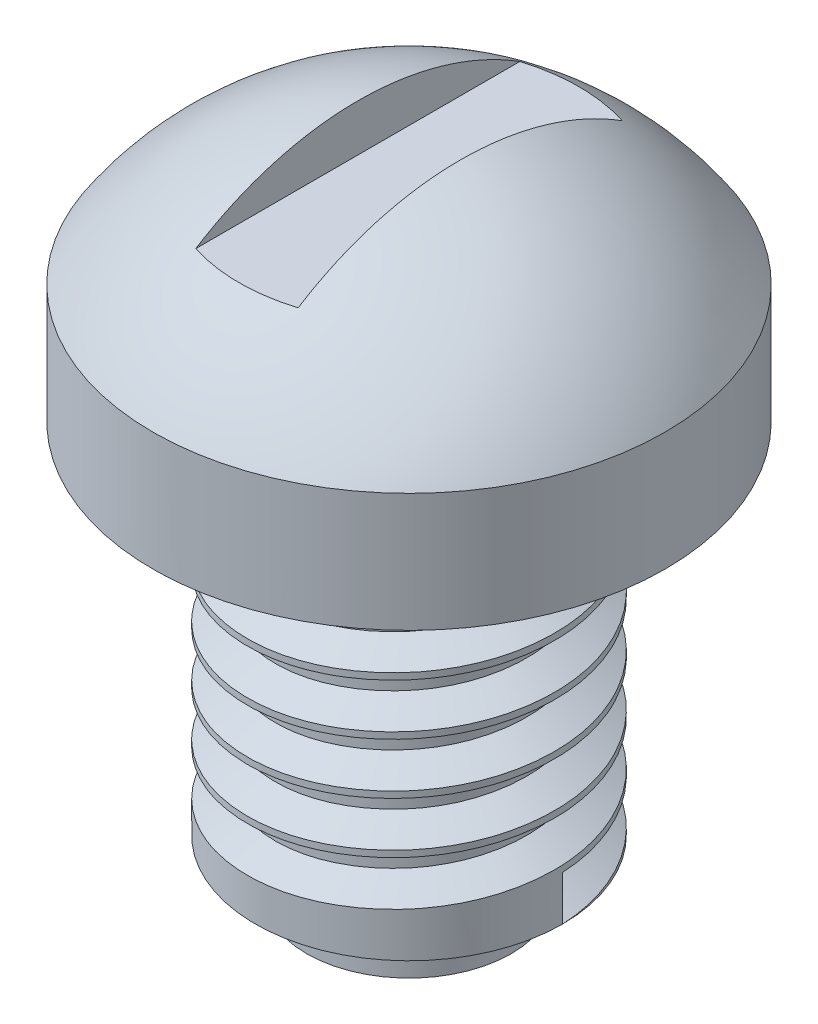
ISO-10303-21;
HEADER;
FILE_DESCRIPTION(('STEP AP214'),'2;1');
FILE_NAME('part.step','',(''),(''),'','','');
FILE_SCHEMA(('AUTOMOTIVE_DESIGN { 1 0 10303 214 1 1 1 1 }'));
ENDSEC;
DATA;
#1=APPLICATION_CONTEXT('core data for automotive mechanical design processes');
#2=APPLICATION_PROTOCOL_DEFINITION('international standard','automotive_design',2000,#1);
#3=PRODUCT_CONTEXT('',#1,'mechanical');
#4=PRODUCT('Part','Part','',(#3));
#5=PRODUCT_RELATED_PRODUCT_CATEGORY('part','',(#4));
#6=PRODUCT_DEFINITION_FORMATION('','',#4);
#7=PRODUCT_DEFINITION_CONTEXT('part definition',#1,'design');
#8=PRODUCT_DEFINITION('design','',#6,#7);
#9=PRODUCT_DEFINITION_SHAPE('','',#8);
#10=(LENGTH_UNIT() NAMED_UNIT(*) SI_UNIT(.MILLI.,.METRE.));
#11=(NAMED_UNIT(*) PLANE_ANGLE_UNIT() SI_UNIT($,.RADIAN.));
#12=(NAMED_UNIT(*) SI_UNIT($,.STERADIAN.) SOLID_ANGLE_UNIT());
#13=UNCERTAINTY_MEASURE_WITH_UNIT(LENGTH_MEASURE(1.E-05),#10,'distance_accuracy_value','');
#14=(GEOMETRIC_REPRESENTATION_CONTEXT(3) GLOBAL_UNCERTAINTY_ASSIGNED_CONTEXT((#13)) GLOBAL_UNIT_ASSIGNED_CONTEXT((#10,
#11,#12)) REPRESENTATION_CONTEXT('',''));
#15=CARTESIAN_POINT('',(0.,0.,0.));
#16=DIRECTION('',(0.,0.,1.));
#17=DIRECTION('',(1.,0.,0.));
#18=AXIS2_PLACEMENT_3D('',#15,#16,#17);
#19=CARTESIAN_POINT('',(0.,-6.,0.));
#20=DIRECTION('',(0.,-1.,0.));
#21=DIRECTION('',(1.,0.,0.));
#22=AXIS2_PLACEMENT_3D('',#19,#20,#21);
#23=CYLINDRICAL_SURFACE('',#22,3.);
#24=CARTESIAN_POINT('',(3.,-6.,0.));
#25=CARTESIAN_POINT('',(3.,-5.9375,-1.24264068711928));
#26=CARTESIAN_POINT('',(2.12132034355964,-5.875,-2.12132034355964));
#27=CARTESIAN_POINT('',(1.24264068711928,-5.8125,-3.));
#28=CARTESIAN_POINT('',(0.,-5.75,-3.));
#29=CARTESIAN_POINT('',(-1.24264068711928,-5.6875,-3.));
#30=CARTESIAN_POINT('',(-2.12132034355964,-5.625,-2.12132034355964));
#31=CARTESIAN_POINT('',(-3.,-5.5625,-1.24264068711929));
#32=CARTESIAN_POINT('',(-3.,-5.5,0.));
#33=CARTESIAN_POINT('',(-3.,-5.4375,1.24264068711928));
#34=CARTESIAN_POINT('',(-2.12132034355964,-5.375,2.12132034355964));
#35=CARTESIAN_POINT('',(-1.24264068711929,-5.3125,3.));
#36=CARTESIAN_POINT('',(0.,-5.25,3.));
#37=CARTESIAN_POINT('',(1.24264068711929,-5.1875,3.));
#38=CARTESIAN_POINT('',(2.12132034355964,-5.125,2.12132034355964));
#39=CARTESIAN_POINT('',(3.,-5.0625,1.24264068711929));
#40=CARTESIAN_POINT('',(3.,-5.,0.));
#41=CARTESIAN_POINT('',(3.,-4.9375,-1.24264068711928));
#42=CARTESIAN_POINT('',(2.12132034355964,-4.875,-2.12132034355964));
#43=CARTESIAN_POINT('',(1.24264068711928,-4.8125,-3.));
#44=CARTESIAN_POINT('',(0.,-4.75,-3.));
#45=CARTESIAN_POINT('',(-1.24264068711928,-4.6875,-3.));
#46=CARTESIAN_POINT('',(-2.12132034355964,-4.625,-2.12132034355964));
#47=CARTESIAN_POINT('',(-3.,-4.5625,-1.24264068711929));
#48=CARTESIAN_POINT('',(-3.,-4.5,0.));
#49=CARTESIAN_POINT('',(-3.,-4.4375,1.24264068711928));
#50=CARTESIAN_POINT('',(-2.12132034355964,-4.375,2.12132034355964));
#51=CARTESIAN_POINT('',(-1.24264068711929,-4.3125,3.));
#52=CARTESIAN_POINT('',(0.,-4.25,3.));
#53=CARTESIAN_POINT('',(1.24264068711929,-4.1875,3.));
#54=CARTESIAN_POINT('',(2.12132034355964,-4.125,2.12132034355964));
#55=CARTESIAN_POINT('',(3.,-4.0625,1.24264068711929));
#56=CARTESIAN_POINT('',(3.,-4.,0.));
#57=CARTESIAN_POINT('',(3.,-3.9375,-1.24264068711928));
#58=CARTESIAN_POINT('',(2.12132034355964,-3.875,-2.12132034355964));
#59=CARTESIAN_POINT('',(1.24264068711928,-3.8125,-3.));
#60=CARTESIAN_POINT('',(0.,-3.75,-3.));
#61=CARTESIAN_POINT('',(-1.24264068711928,-3.6875,-3.));
#62=CARTESIAN_POINT('',(-2.12132034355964,-3.625,-2.12132034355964));
#63=CARTESIAN_POINT('',(-3.,-3.5625,-1.24264068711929));
#64=CARTESIAN_POINT('',(-3.,-3.5,0.));
#65=CARTESIAN_POINT('',(-3.,-3.4375,1.24264068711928));
#66=CARTESIAN_POINT('',(-2.12132034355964,-3.375,2.12132034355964));
#67=CARTESIAN_POINT('',(-1.24264068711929,-3.3125,3.));
#68=CARTESIAN_POINT('',(0.,-3.25,3.));
#69=CARTESIAN_POINT('',(1.24264068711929,-3.1875,3.));
#70=CARTESIAN_POINT('',(2.12132034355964,-3.125,2.12132034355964));
#71=CARTESIAN_POINT('',(3.,-3.0625,1.24264068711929));
#72=CARTESIAN_POINT('',(3.,-3.,0.));
#73=CARTESIAN_POINT('',(3.,-2.9375,-1.24264068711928));
#74=CARTESIAN_POINT('',(2.12132034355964,-2.875,-2.12132034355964));
#75=CARTESIAN_POINT('',(1.24264068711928,-2.8125,-3.));
#76=CARTESIAN_POINT('',(0.,-2.75,-3.));
#77=CARTESIAN_POINT('',(-1.24264068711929,-2.6875,-3.));
#78=CARTESIAN_POINT('',(-2.12132034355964,-2.625,-2.12132034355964));
#79=CARTESIAN_POINT('',(-3.,-2.5625,-1.24264068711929));
#80=CARTESIAN_POINT('',(-3.,-2.5,0.));
#81=CARTESIAN_POINT('',(-3.,-2.4375,1.24264068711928));
#82=CARTESIAN_POINT('',(-2.12132034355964,-2.375,2.12132034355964));
#83=CARTESIAN_POINT('',(-1.24264068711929,-2.3125,3.));
#84=CARTESIAN_POINT('',(0.,-2.25,3.));
#85=CARTESIAN_POINT('',(1.24264068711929,-2.1875,3.));
#86=CARTESIAN_POINT('',(2.12132034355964,-2.125,2.12132034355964));
#87=CARTESIAN_POINT('',(3.,-2.0625,1.24264068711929));
#88=CARTESIAN_POINT('',(3.,-2.,0.));
#89=CARTESIAN_POINT('',(3.,-1.9375,-1.24264068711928));
#90=CARTESIAN_POINT('',(2.12132034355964,-1.875,-2.12132034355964));
#91=CARTESIAN_POINT('',(1.24264068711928,-1.8125,-3.));
#92=CARTESIAN_POINT('',(0.,-1.75,-3.));
#93=CARTESIAN_POINT('',(-1.24264068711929,-1.6875,-3.));
#94=CARTESIAN_POINT('',(-2.12132034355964,-1.625,-2.12132034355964));
#95=CARTESIAN_POINT('',(-3.,-1.5625,-1.24264068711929));
#96=CARTESIAN_POINT('',(-3.,-1.5,0.));
#97=CARTESIAN_POINT('',(-3.,-1.4375,1.24264068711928));
#98=CARTESIAN_POINT('',(-2.12132034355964,-1.375,2.12132034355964));
#99=CARTESIAN_POINT('',(-1.24264068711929,-1.3125,3.));
#100=CARTESIAN_POINT('',(0.,-1.25,3.));
#101=CARTESIAN_POINT('',(1.24264068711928,-1.1875,3.));
#102=CARTESIAN_POINT('',(2.12132034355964,-1.125,2.12132034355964));
#103=CARTESIAN_POINT('',(3.,-1.0625,1.24264068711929));
#104=CARTESIAN_POINT('',(3.,-1.,0.));
#105=CARTESIAN_POINT('',(3.,-0.9375,-1.24264068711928));
#106=CARTESIAN_POINT('',(2.12132034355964,-0.875,-2.12132034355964));
#107=CARTESIAN_POINT('',(1.24264068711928,-0.8125,-3.));
#108=CARTESIAN_POINT('',(0.,-0.75,-3.));
#109=CARTESIAN_POINT('',(-1.24264068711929,-0.6875,-3.));
#110=CARTESIAN_POINT('',(-2.12132034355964,-0.625,-2.12132034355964));
#111=CARTESIAN_POINT('',(-3.,-0.5625,-1.24264068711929));
#112=CARTESIAN_POINT('',(-3.,-0.5,0.));
#113=CARTESIAN_POINT('',(-3.,-0.4375,1.24264068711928));
#114=CARTESIAN_POINT('',(-2.12132034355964,-0.375,2.12132034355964));
#115=CARTESIAN_POINT('',(-1.24264068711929,-0.3125,3.));
#116=CARTESIAN_POINT('',(0.,-0.25,3.));
#117=CARTESIAN_POINT('',(1.24264068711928,-0.1875,3.));
#118=CARTESIAN_POINT('',(2.12132034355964,-0.125,2.12132034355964));
#119=CARTESIAN_POINT('',(3.,-0.0625000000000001,1.24264068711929));
#120=CARTESIAN_POINT('',(3.,0.,0.));
#121=CARTESIAN_POINT('',(3.,0.0625000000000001,-1.24264068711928));
#122=CARTESIAN_POINT('',(2.12132034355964,0.125,-2.12132034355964));
#123=CARTESIAN_POINT('',(1.24264068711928,0.1875,-3.));
#124=CARTESIAN_POINT('',(0.,0.25,-3.));
#125=CARTESIAN_POINT('',(-1.24264068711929,0.3125,-3.));
#126=CARTESIAN_POINT('',(-2.12132034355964,0.375,-2.12132034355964));
#127=CARTESIAN_POINT('',(-3.,0.4375,-1.24264068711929));
#128=CARTESIAN_POINT('',(-3.,0.5,0.));
#129=CARTESIAN_POINT('',(-3.,0.5625,1.24264068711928));
#130=CARTESIAN_POINT('',(-2.12132034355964,0.625,2.12132034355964));
#131=CARTESIAN_POINT('',(-1.24264068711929,0.6875,3.));
#132=CARTESIAN_POINT('',(0.,0.75,3.));
#133=CARTESIAN_POINT('',(1.24264068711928,0.8125,3.));
#134=CARTESIAN_POINT('',(2.12132034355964,0.875,2.12132034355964));
#135=CARTESIAN_POINT('',(3.,0.9375,1.24264068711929));
#136=CARTESIAN_POINT('',(3.,1.,0.));
#137=(BOUNDED_CURVE() B_SPLINE_CURVE(2,(#24,#25,#26,#27,#28,#29,#30,#31,#32,#33,#34,#35,#36,#37,
#38,#39,#40,#41,#42,#43,#44,#45,#46,#47,#48,#49,#50,#51,#52,#53,#54,#55,#56,#57,#58,#59,#60,#61,
#62,#63,#64,#65,#66,#67,#68,#69,#70,#71,#72,#73,#74,#75,#76,#77,#78,#79,#80,#81,#82,#83,#84,#85,
#86,#87,#88,#89,#90,#91,#92,#93,#94,#95,#96,#97,#98,#99,#100,#101,#102,#103,#104,#105,#106,#107,
#108,#109,#110,#111,#112,#113,#114,#115,#116,#117,#118,#119,#120,#121,#122,#123,#124,#125,#126,
#127,#128,#129,#130,#131,#132,#133,#134,#135,#136),.UNSPECIFIED.,.F.,
.F.) B_SPLINE_CURVE_WITH_KNOTS((3,2,2,2,2,2,2,2,2,2,2,2,2,2,2,2,2,2,2,2,2,2,2,2,2,2,2,2,2,2,2,2,
2,2,2,2,2,2,2,2,2,2,2,2,2,2,2,2,2,2,2,2,2,2,2,2,3),(0.,0.0178571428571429,0.0357142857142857,
0.0535714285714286,0.0714285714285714,0.0892857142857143,0.107142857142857,0.125,
0.142857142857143,0.160714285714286,0.178571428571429,0.196428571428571,0.214285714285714,
0.232142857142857,0.25,0.267857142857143,0.285714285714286,0.303571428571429,0.321428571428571,
0.339285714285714,0.357142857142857,0.375,0.392857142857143,0.410714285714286,0.428571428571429,
0.446428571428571,0.464285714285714,0.482142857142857,0.5,0.517857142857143,0.535714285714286,
0.553571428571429,0.571428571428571,0.589285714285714,0.607142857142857,0.625,0.642857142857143,
0.660714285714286,0.678571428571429,0.696428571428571,0.714285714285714,0.732142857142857,0.75,
0.767857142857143,0.785714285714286,0.803571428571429,0.821428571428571,0.839285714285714,
0.857142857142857,0.875,0.892857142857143,0.910714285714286,0.928571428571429,0.946428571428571,
0.964285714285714,0.982142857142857,1.),
.UNSPECIFIED.) CURVE() GEOMETRIC_REPRESENTATION_ITEM() RATIONAL_B_SPLINE_CURVE((1.,
0.923879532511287,1.,0.923879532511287,1.,0.923879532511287,1.,0.923879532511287,1.,
0.923879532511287,1.,0.923879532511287,1.,0.923879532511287,1.,0.923879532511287,1.,
0.923879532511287,1.,0.923879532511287,1.,0.923879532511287,1.,0.923879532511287,1.,
0.923879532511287,1.,0.923879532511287,1.,0.923879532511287,1.,0.923879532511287,1.,
0.923879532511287,1.,0.923879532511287,1.,0.923879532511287,1.,0.923879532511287,1.,
0.923879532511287,1.,0.923879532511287,1.,0.923879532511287,1.,0.923879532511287,1.,
0.923879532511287,1.,0.923879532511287,1.,0.923879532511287,1.,0.923879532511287,1.,
0.923879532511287,1.,0.923879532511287,1.,0.923879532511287,1.,0.923879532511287,1.,
0.923879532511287,1.,0.923879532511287,1.,0.923879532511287,1.,0.923879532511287,1.,
0.923879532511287,1.,0.923879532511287,1.,0.923879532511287,1.,0.923879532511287,1.,
0.923879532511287,1.,0.923879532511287,1.,0.923879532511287,1.,0.923879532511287,1.,
0.923879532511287,1.,0.923879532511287,1.,0.923879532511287,1.,0.923879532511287,1.,
0.923879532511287,1.,0.923879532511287,1.,0.923879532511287,1.,0.923879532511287,1.,
0.923879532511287,1.,0.923879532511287,1.,0.923879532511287,1.,0.923879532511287,1.)) REPRESENTATION_ITEM(''));
#138=CARTESIAN_POINT('',(3.,-6.,0.));
#139=VERTEX_POINT('',#138);
#140=CARTESIAN_POINT('',(3.,1.,0.));
#141=VERTEX_POINT('',#140);
#142=EDGE_CURVE('E96',#139,#141,#137,.T.);
#143=ORIENTED_EDGE('',*,*,#142,.F.);
#144=CARTESIAN_POINT('',(0.,-6.,0.));
#145=DIRECTION('',(0.,-1.,0.));
#146=DIRECTION('',(1.,0.,0.));
#147=AXIS2_PLACEMENT_3D('',#144,#145,#146);
#148=CIRCLE('',#147,3.);
#149=EDGE_CURVE('E110',#139,#139,#148,.T.);
#150=ORIENTED_EDGE('',*,*,#149,.F.);
#151=DIRECTION('',(0.,1.,0.));
#152=VECTOR('',#151,1.);
#153=CARTESIAN_POINT('',(3.,-5.56250000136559,0.));
#154=LINE('',#153,#152);
#155=CARTESIAN_POINT('',(3.,-5.12500000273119,0.));
#156=VERTEX_POINT('',#155);
#157=EDGE_CURVE('E102',#139,#156,#154,.T.);
#158=ORIENTED_EDGE('',*,*,#157,.T.);
#159=CARTESIAN_POINT('',(3.,-5.12500000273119,0.));
#160=CARTESIAN_POINT('',(3.,-5.06250000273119,-1.24264068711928));
#161=CARTESIAN_POINT('',(2.12132034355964,-5.00000000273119,-2.12132034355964));
#162=CARTESIAN_POINT('',(1.24264068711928,-4.93750000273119,-3.));
#163=CARTESIAN_POINT('',(0.,-4.87500000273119,-3.));
#164=CARTESIAN_POINT('',(-1.24264068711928,-4.81250000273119,-3.));
#165=CARTESIAN_POINT('',(-2.12132034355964,-4.75000000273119,-2.12132034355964));
#166=CARTESIAN_POINT('',(-3.,-4.68750000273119,-1.24264068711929));
#167=CARTESIAN_POINT('',(-3.,-4.62500000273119,0.));
#168=CARTESIAN_POINT('',(-3.,-4.56250000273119,1.24264068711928));
#169=CARTESIAN_POINT('',(-2.12132034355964,-4.50000000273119,2.12132034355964));
#170=CARTESIAN_POINT('',(-1.24264068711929,-4.43750000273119,3.));
#171=CARTESIAN_POINT('',(0.,-4.37500000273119,3.));
#172=CARTESIAN_POINT('',(1.24264068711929,-4.31250000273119,3.));
#173=CARTESIAN_POINT('',(2.12132034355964,-4.25000000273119,2.12132034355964));
#174=CARTESIAN_POINT('',(3.,-4.18750000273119,1.24264068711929));
#175=CARTESIAN_POINT('',(3.,-4.12500000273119,0.));
#176=CARTESIAN_POINT('',(3.,-4.06250000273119,-1.24264068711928));
#177=CARTESIAN_POINT('',(2.12132034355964,-4.00000000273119,-2.12132034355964));
#178=CARTESIAN_POINT('',(1.24264068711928,-3.93750000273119,-3.));
#179=CARTESIAN_POINT('',(0.,-3.87500000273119,-3.));
#180=CARTESIAN_POINT('',(-1.24264068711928,-3.81250000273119,-3.));
#181=CARTESIAN_POINT('',(-2.12132034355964,-3.75000000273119,-2.12132034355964));
#182=CARTESIAN_POINT('',(-3.,-3.68750000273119,-1.24264068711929));
#183=CARTESIAN_POINT('',(-3.,-3.62500000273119,0.));
#184=CARTESIAN_POINT('',(-3.,-3.56250000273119,1.24264068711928));
#185=CARTESIAN_POINT('',(-2.12132034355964,-3.50000000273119,2.12132034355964));
#186=CARTESIAN_POINT('',(-1.24264068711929,-3.43750000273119,3.));
#187=CARTESIAN_POINT('',(0.,-3.37500000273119,3.));
#188=CARTESIAN_POINT('',(1.24264068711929,-3.31250000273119,3.));
#189=CARTESIAN_POINT('',(2.12132034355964,-3.25000000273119,2.12132034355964));
#190=CARTESIAN_POINT('',(3.,-3.18750000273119,1.24264068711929));
#191=CARTESIAN_POINT('',(3.,-3.12500000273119,0.));
#192=CARTESIAN_POINT('',(3.,-3.06250000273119,-1.24264068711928));
#193=CARTESIAN_POINT('',(2.12132034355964,-3.00000000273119,-2.12132034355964));
#194=CARTESIAN_POINT('',(1.24264068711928,-2.93750000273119,-3.));
#195=CARTESIAN_POINT('',(0.,-2.87500000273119,-3.));
#196=CARTESIAN_POINT('',(-1.24264068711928,-2.81250000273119,-3.));
#197=CARTESIAN_POINT('',(-2.12132034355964,-2.75000000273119,-2.12132034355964));
#198=CARTESIAN_POINT('',(-3.,-2.68750000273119,-1.24264068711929));
#199=CARTESIAN_POINT('',(-3.,-2.62500000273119,0.));
#200=CARTESIAN_POINT('',(-3.,-2.56250000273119,1.24264068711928));
#201=CARTESIAN_POINT('',(-2.12132034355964,-2.50000000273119,2.12132034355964));
#202=CARTESIAN_POINT('',(-1.24264068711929,-2.43750000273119,3.));
#203=CARTESIAN_POINT('',(0.,-2.37500000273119,3.));
#204=CARTESIAN_POINT('',(1.24264068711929,-2.31250000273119,3.));
#205=CARTESIAN_POINT('',(2.12132034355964,-2.25000000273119,2.12132034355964));
#206=CARTESIAN_POINT('',(3.,-2.18750000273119,1.24264068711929));
#207=CARTESIAN_POINT('',(3.,-2.12500000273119,0.));
#208=CARTESIAN_POINT('',(3.,-2.06250000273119,-1.24264068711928));
#209=CARTESIAN_POINT('',(2.12132034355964,-2.00000000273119,-2.12132034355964));
#210=CARTESIAN_POINT('',(1.24264068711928,-1.93750000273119,-3.));
#211=CARTESIAN_POINT('',(0.,-1.87500000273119,-3.));
#212=CARTESIAN_POINT('',(-1.24264068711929,-1.81250000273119,-3.));
#213=CARTESIAN_POINT('',(-2.12132034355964,-1.75000000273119,-2.12132034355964));
#214=CARTESIAN_POINT('',(-3.,-1.68750000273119,-1.24264068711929));
#215=CARTESIAN_POINT('',(-3.,-1.62500000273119,0.));
#216=CARTESIAN_POINT('',(-3.,-1.56250000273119,1.24264068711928));
#217=CARTESIAN_POINT('',(-2.12132034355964,-1.50000000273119,2.12132034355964));
#218=CARTESIAN_POINT('',(-1.24264068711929,-1.43750000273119,3.));
#219=CARTESIAN_POINT('',(0.,-1.37500000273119,3.));
#220=CARTESIAN_POINT('',(1.24264068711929,-1.31250000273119,3.));
#221=CARTESIAN_POINT('',(2.12132034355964,-1.25000000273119,2.12132034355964));
#222=CARTESIAN_POINT('',(3.,-1.18750000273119,1.24264068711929));
#223=CARTESIAN_POINT('',(3.,-1.12500000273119,0.));
#224=CARTESIAN_POINT('',(3.,-1.06250000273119,-1.24264068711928));
#225=CARTESIAN_POINT('',(2.12132034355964,-1.00000000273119,-2.12132034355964));
#226=CARTESIAN_POINT('',(1.24264068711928,-0.937500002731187,-3.));
#227=CARTESIAN_POINT('',(0.,-0.875000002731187,-3.));
#228=CARTESIAN_POINT('',(-1.24264068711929,-0.812500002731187,-3.));
#229=CARTESIAN_POINT('',(-2.12132034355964,-0.750000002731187,-2.12132034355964));
#230=CARTESIAN_POINT('',(-3.,-0.687500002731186,-1.24264068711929));
#231=CARTESIAN_POINT('',(-3.,-0.625000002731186,0.));
#232=CARTESIAN_POINT('',(-3.,-0.562500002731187,1.24264068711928));
#233=CARTESIAN_POINT('',(-2.12132034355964,-0.500000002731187,2.12132034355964));
#234=CARTESIAN_POINT('',(-1.24264068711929,-0.437500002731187,3.));
#235=CARTESIAN_POINT('',(0.,-0.375000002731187,3.));
#236=CARTESIAN_POINT('',(1.24264068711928,-0.312500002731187,3.));
#237=CARTESIAN_POINT('',(2.12132034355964,-0.250000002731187,2.12132034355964));
#238=CARTESIAN_POINT('',(3.,-0.187500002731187,1.24264068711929));
#239=CARTESIAN_POINT('',(3.,-0.125000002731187,0.));
#240=CARTESIAN_POINT('',(3.,-0.0625000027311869,-1.24264068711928));
#241=CARTESIAN_POINT('',(2.12132034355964,-2.73118680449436E-09,-2.12132034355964));
#242=CARTESIAN_POINT('',(1.24264068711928,0.0624999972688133,-3.));
#243=CARTESIAN_POINT('',(0.,0.124999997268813,-3.));
#244=CARTESIAN_POINT('',(-1.24264068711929,0.187499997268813,-3.));
#245=CARTESIAN_POINT('',(-2.12132034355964,0.249999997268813,-2.12132034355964));
#246=CARTESIAN_POINT('',(-3.,0.312499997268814,-1.24264068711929));
#247=CARTESIAN_POINT('',(-3.,0.374999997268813,0.));
#248=CARTESIAN_POINT('',(-3.,0.437499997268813,1.24264068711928));
#249=CARTESIAN_POINT('',(-2.12132034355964,0.499999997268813,2.12132034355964));
#250=CARTESIAN_POINT('',(-1.24264068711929,0.562499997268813,3.));
#251=CARTESIAN_POINT('',(0.,0.624999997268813,3.));
#252=CARTESIAN_POINT('',(1.24264068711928,0.687499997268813,3.));
#253=CARTESIAN_POINT('',(2.12132034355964,0.749999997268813,2.12132034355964));
#254=CARTESIAN_POINT('',(3.,0.812499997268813,1.24264068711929));
#255=CARTESIAN_POINT('',(3.,0.874999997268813,0.));
#256=CARTESIAN_POINT('',(3.,0.937499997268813,-1.24264068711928));
#257=CARTESIAN_POINT('',(2.12132034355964,0.999999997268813,-2.12132034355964));
#258=CARTESIAN_POINT('',(1.24264068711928,1.06249999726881,-3.));
#259=CARTESIAN_POINT('',(0.,1.12499999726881,-3.));
#260=CARTESIAN_POINT('',(-1.24264068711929,1.18749999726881,-3.));
#261=CARTESIAN_POINT('',(-2.12132034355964,1.24999999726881,-2.12132034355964));
#262=CARTESIAN_POINT('',(-3.,1.31249999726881,-1.24264068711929));
#263=CARTESIAN_POINT('',(-3.,1.37499999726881,0.));
#264=CARTESIAN_POINT('',(-3.,1.43749999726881,1.24264068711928));
#265=CARTESIAN_POINT('',(-2.12132034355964,1.49999999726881,2.12132034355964));
#266=CARTESIAN_POINT('',(-1.24264068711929,1.56249999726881,3.));
#267=CARTESIAN_POINT('',(0.,1.62499999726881,3.));
#268=CARTESIAN_POINT('',(1.24264068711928,1.68749999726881,3.));
#269=CARTESIAN_POINT('',(2.12132034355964,1.74999999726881,2.12132034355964));
#270=CARTESIAN_POINT('',(3.,1.81249999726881,1.24264068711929));
#271=CARTESIAN_POINT('',(3.,1.87499999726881,0.));
#272=(BOUNDED_CURVE() B_SPLINE_CURVE(2,(#159,#160,#161,#162,#163,#164,#165,#166,#167,#168,#169,
#170,#171,#172,#173,#174,#175,#176,#177,#178,#179,#180,#181,#182,#183,#184,#185,#186,#187,#188,
#189,#190,#191,#192,#193,#194,#195,#196,#197,#198,#199,#200,#201,#202,#203,#204,#205,#206,#207,
#208,#209,#210,#211,#212,#213,#214,#215,#216,#217,#218,#219,#220,#221,#222,#223,#224,#225,#226,
#227,#228,#229,#230,#231,#232,#233,#234,#235,#236,#237,#238,#239,#240,#241,#242,#243,#244,#245,
#246,#247,#248,#249,#250,#251,#252,#253,#254,#255,#256,#257,#258,#259,#260,#261,#262,#263,#264,
#265,#266,#267,#268,#269,#270,#271),.UNSPECIFIED.,.F.,.F.) B_SPLINE_CURVE_WITH_KNOTS((3,2,2,2,2,
2,2,2,2,2,2,2,2,2,2,2,2,2,2,2,2,2,2,2,2,2,2,2,2,2,2,2,2,2,2,2,2,2,2,2,2,2,2,2,2,2,2,2,2,2,2,2,2,
2,2,2,3),(0.,0.0178571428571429,0.0357142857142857,0.0535714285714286,0.0714285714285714,
0.0892857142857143,0.107142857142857,0.125,0.142857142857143,0.160714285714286,
0.178571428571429,0.196428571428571,0.214285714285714,0.232142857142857,0.25,0.267857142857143,
0.285714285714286,0.303571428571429,0.321428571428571,0.339285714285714,0.357142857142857,0.375,
0.392857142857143,0.410714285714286,0.428571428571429,0.446428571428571,0.464285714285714,
0.482142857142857,0.5,0.517857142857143,0.535714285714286,0.553571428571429,0.571428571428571,
0.589285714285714,0.607142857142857,0.625,0.642857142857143,0.660714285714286,0.678571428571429,
0.696428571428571,0.714285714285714,0.732142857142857,0.75,0.767857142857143,0.785714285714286,
0.803571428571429,0.821428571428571,0.839285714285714,0.857142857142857,0.875,0.892857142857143,
0.910714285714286,0.928571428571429,0.946428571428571,0.964285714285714,0.982142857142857,1.),
.UNSPECIFIED.) CURVE() GEOMETRIC_REPRESENTATION_ITEM() RATIONAL_B_SPLINE_CURVE((1.,
0.923879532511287,1.,0.923879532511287,1.,0.923879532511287,1.,0.923879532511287,1.,
0.923879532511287,1.,0.923879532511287,1.,0.923879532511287,1.,0.923879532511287,1.,
0.923879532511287,1.,0.923879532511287,1.,0.923879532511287,1.,0.923879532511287,1.,
0.923879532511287,1.,0.923879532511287,1.,0.923879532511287,1.,0.923879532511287,1.,
0.923879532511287,1.,0.923879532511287,1.,0.923879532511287,1.,0.923879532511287,1.,
0.923879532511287,1.,0.923879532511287,1.,0.923879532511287,1.,0.923879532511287,1.,
0.923879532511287,1.,0.923879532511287,1.,0.923879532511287,1.,0.923879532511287,1.,
0.923879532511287,1.,0.923879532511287,1.,0.923879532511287,1.,0.923879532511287,1.,
0.923879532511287,1.,0.923879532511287,1.,0.923879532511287,1.,0.923879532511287,1.,
0.923879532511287,1.,0.923879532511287,1.,0.923879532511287,1.,0.923879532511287,1.,
0.923879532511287,1.,0.923879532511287,1.,0.923879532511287,1.,0.923879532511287,1.,
0.923879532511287,1.,0.923879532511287,1.,0.923879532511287,1.,0.923879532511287,1.,
0.923879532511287,1.,0.923879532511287,1.,0.923879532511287,1.,0.923879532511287,1.,
0.923879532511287,1.,0.923879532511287,1.,0.923879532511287,1.,0.923879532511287,1.)) REPRESENTATION_ITEM(''));
#273=CARTESIAN_POINT('',(2.12132030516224,0.999999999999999,-2.12132038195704));
#274=VERTEX_POINT('',#273);
#275=EDGE_CURVE('E87',#156,#274,#272,.T.);
#276=ORIENTED_EDGE('',*,*,#275,.T.);
#277=CARTESIAN_POINT('',(0.,0.999999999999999,0.));
#278=DIRECTION('',(0.,-1.,0.));
#279=DIRECTION('',(1.,0.,0.));
#280=AXIS2_PLACEMENT_3D('',#277,#278,#279);
#281=CIRCLE('',#280,3.);
#282=EDGE_CURVE('E124',#274,#141,#281,.T.);
#283=ORIENTED_EDGE('',*,*,#282,.T.);
#284=EDGE_LOOP('',(#143,#150,#158,#276,#283));
#285=FACE_BOUND('',#284,.T.);
#286=ADVANCED_FACE('F33',(#285),#23,.T.);
#287=CARTESIAN_POINT('',(-3.,-6.,0.));
#288=DIRECTION('',(0.,1.,0.));
#289=DIRECTION('',(-1.,0.,0.));
#290=AXIS2_PLACEMENT_3D('',#287,#288,#289);
#291=PLANE('',#290);
#292=CARTESIAN_POINT('',(0.,-6.,0.));
#293=DIRECTION('',(0.,1.,0.));
#294=DIRECTION('',(-1.,0.,0.));
#295=AXIS2_PLACEMENT_3D('',#292,#293,#294);
#296=CIRCLE('',#295,2.);
#297=CARTESIAN_POINT('',(-2.,-6.,0.));
#298=VERTEX_POINT('',#297);
#299=EDGE_CURVE('E11',#298,#298,#296,.F.);
#300=ORIENTED_EDGE('',*,*,#299,.F.);
#301=EDGE_LOOP('',(#300));
#302=FACE_BOUND('',#301,.T.);
#303=ORIENTED_EDGE('',*,*,#149,.T.);
#304=EDGE_LOOP('',(#303));
#305=FACE_BOUND('',#304,.T.);
#306=ADVANCED_FACE('F35',(#302,#305),#291,.F.);
#307=CARTESIAN_POINT('',(0.,0.,0.));
#308=DIRECTION('',(0.,-1.,0.));
#309=DIRECTION('',(-1.,0.,0.));
#310=AXIS2_PLACEMENT_3D('',#307,#308,#309);
#311=SPHERICAL_SURFACE('',#310,6.);
#312=CARTESIAN_POINT('',(1.,0.,0.));
#313=DIRECTION('',(-1.,0.,0.));
#314=DIRECTION('',(0.,-1.,0.));
#315=AXIS2_PLACEMENT_3D('',#312,#313,#314);
#316=CIRCLE('',#315,5.91607978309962);
#317=CARTESIAN_POINT('',(1.,5.,3.16227766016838));
#318=VERTEX_POINT('',#317);
#319=CARTESIAN_POINT('',(1.,5.,-3.16227766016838));
#320=VERTEX_POINT('',#319);
#321=EDGE_CURVE('E136',#318,#320,#316,.T.);
#322=ORIENTED_EDGE('',*,*,#321,.F.);
#323=CARTESIAN_POINT('',(0.,5.,0.));
#324=DIRECTION('',(0.,-1.,0.));
#325=DIRECTION('',(1.,0.,0.));
#326=AXIS2_PLACEMENT_3D('',#323,#324,#325);
#327=CIRCLE('',#326,3.3166247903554);
#328=CARTESIAN_POINT('',(-1.,5.,3.16227766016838));
#329=VERTEX_POINT('',#328);
#330=EDGE_CURVE('E41',#318,#329,#327,.T.);
#331=ORIENTED_EDGE('',*,*,#330,.T.);
#332=CARTESIAN_POINT('',(-0.99999999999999,0.,0.));
#333=DIRECTION('',(-1.,0.,0.));
#334=DIRECTION('',(0.,-1.,0.));
#335=AXIS2_PLACEMENT_3D('',#332,#333,#334);
#336=CIRCLE('',#335,5.91607978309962);
#337=CARTESIAN_POINT('',(-1.,5.,-3.16227766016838));
#338=VERTEX_POINT('',#337);
#339=EDGE_CURVE('E137',#329,#338,#336,.T.);
#340=ORIENTED_EDGE('',*,*,#339,.T.);
#341=EDGE_CURVE('E133',#338,#320,#327,.T.);
#342=ORIENTED_EDGE('',*,*,#341,.T.);
#343=EDGE_LOOP('',(#322,#331,#340,#342));
#344=FACE_BOUND('',#343,.T.);
#345=CARTESIAN_POINT('',(0.,3.3166247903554,0.));
#346=DIRECTION('',(0.,-1.,0.));
#347=DIRECTION('',(1.,0.,0.));
#348=AXIS2_PLACEMENT_3D('',#345,#346,#347);
#349=CIRCLE('',#348,5.);
#350=CARTESIAN_POINT('',(5.,3.3166247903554,0.));
#351=VERTEX_POINT('',#350);
#352=EDGE_CURVE('E130',#351,#351,#349,.T.);
#353=ORIENTED_EDGE('',*,*,#352,.F.);
#354=EDGE_LOOP('',(#353));
#355=FACE_BOUND('',#354,.T.);
#356=ADVANCED_FACE('F142',(#344,#355),#311,.T.);
#357=CARTESIAN_POINT('',(0.,-6.,0.));
#358=DIRECTION('',(0.,-1.,0.));
#359=DIRECTION('',(1.,0.,0.));
#360=AXIS2_PLACEMENT_3D('',#357,#358,#359);
#361=CYLINDRICAL_SURFACE('',#360,5.);
#362=CARTESIAN_POINT('',(0.,1.,0.));
#363=DIRECTION('',(0.,-1.,0.));
#364=DIRECTION('',(1.,0.,0.));
#365=AXIS2_PLACEMENT_3D('',#362,#363,#364);
#366=CIRCLE('',#365,5.);
#367=CARTESIAN_POINT('',(5.,1.,0.));
#368=VERTEX_POINT('',#367);
#369=EDGE_CURVE('E127',#368,#368,#366,.T.);
#370=ORIENTED_EDGE('',*,*,#369,.F.);
#371=EDGE_LOOP('',(#370));
#372=FACE_BOUND('',#371,.T.);
#373=ORIENTED_EDGE('',*,*,#352,.T.);
#374=EDGE_LOOP('',(#373));
#375=FACE_BOUND('',#374,.T.);
#376=ADVANCED_FACE('F158',(#372,#375),#361,.T.);
#377=CARTESIAN_POINT('',(-5.,0.999999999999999,0.));
#378=DIRECTION('',(0.,1.,0.));
#379=DIRECTION('',(-1.,0.,0.));
#380=AXIS2_PLACEMENT_3D('',#377,#378,#379);
#381=PLANE('',#380);
#382=EDGE_CURVE('E125',#141,#274,#281,.T.);
#383=ORIENTED_EDGE('',*,*,#382,.F.);
#384=ORIENTED_EDGE('',*,*,#282,.F.);
#385=EDGE_LOOP('',(#383,#384));
#386=FACE_BOUND('',#385,.T.);
#387=ORIENTED_EDGE('',*,*,#369,.T.);
#388=EDGE_LOOP('',(#387));
#389=FACE_BOUND('',#388,.T.);
#390=ADVANCED_FACE('F151',(#386,#389),#381,.F.);
#391=CARTESIAN_POINT('',(-1.,6.,-5.));
#392=DIRECTION('',(-1.,0.,0.));
#393=DIRECTION('',(0.,-1.,0.));
#394=AXIS2_PLACEMENT_3D('',#391,#392,#393);
#395=PLANE('',#394);
#396=DIRECTION('',(0.,0.,1.));
#397=VECTOR('',#396,1.);
#398=CARTESIAN_POINT('',(-1.,5.,-5.));
#399=LINE('',#398,#397);
#400=EDGE_CURVE('E118',#338,#329,#399,.T.);
#401=ORIENTED_EDGE('',*,*,#400,.F.);
#402=ORIENTED_EDGE('',*,*,#339,.F.);
#403=EDGE_LOOP('',(#401,#402));
#404=FACE_BOUND('',#403,.T.);
#405=ADVANCED_FACE('F149',(#404),#395,.F.);
#406=CARTESIAN_POINT('',(1.,6.,-5.));
#407=DIRECTION('',(-1.,0.,0.));
#408=DIRECTION('',(0.,-1.,0.));
#409=AXIS2_PLACEMENT_3D('',#406,#407,#408);
#410=PLANE('',#409);
#411=ORIENTED_EDGE('',*,*,#321,.T.);
#412=DIRECTION('',(0.,0.,1.));
#413=VECTOR('',#412,1.);
#414=CARTESIAN_POINT('',(1.,5.,-5.));
#415=LINE('',#414,#413);
#416=EDGE_CURVE('E56',#320,#318,#415,.T.);
#417=ORIENTED_EDGE('',*,*,#416,.T.);
#418=EDGE_LOOP('',(#411,#417));
#419=FACE_BOUND('',#418,.T.);
#420=ADVANCED_FACE('F147',(#419),#410,.T.);
#421=CARTESIAN_POINT('',(-1.,5.,-5.));
#422=DIRECTION('',(0.,-1.,0.));
#423=DIRECTION('',(1.,0.,0.));
#424=AXIS2_PLACEMENT_3D('',#421,#422,#423);
#425=PLANE('',#424);
#426=ORIENTED_EDGE('',*,*,#416,.F.);
#427=ORIENTED_EDGE('',*,*,#341,.F.);
#428=ORIENTED_EDGE('',*,*,#400,.T.);
#429=ORIENTED_EDGE('',*,*,#330,.F.);
#430=EDGE_LOOP('',(#426,#427,#428,#429));
#431=FACE_BOUND('',#430,.T.);
#432=ADVANCED_FACE('F144',(#431),#425,.F.);
#433=CARTESIAN_POINT('',(0.,-7.,0.));
#434=DIRECTION('',(0.,1.,0.));
#435=DIRECTION('',(-1.,0.,0.));
#436=AXIS2_PLACEMENT_3D('',#433,#434,#435);
#437=CYLINDRICAL_SURFACE('',#436,2.);
#438=CARTESIAN_POINT('',(0.,-7.,0.));
#439=DIRECTION('',(0.,-1.,0.));
#440=DIRECTION('',(1.,0.,0.));
#441=AXIS2_PLACEMENT_3D('',#438,#439,#440);
#442=CIRCLE('',#441,2.);
#443=CARTESIAN_POINT('',(2.,-7.,0.));
#444=VERTEX_POINT('',#443);
#445=EDGE_CURVE('E115',#444,#444,#442,.T.);
#446=ORIENTED_EDGE('',*,*,#445,.F.);
#447=EDGE_LOOP('',(#446));
#448=FACE_BOUND('',#447,.T.);
#449=ORIENTED_EDGE('',*,*,#299,.T.);
#450=EDGE_LOOP('',(#449));
#451=FACE_BOUND('',#450,.T.);
#452=ADVANCED_FACE('F276',(#448,#451),#437,.T.);
#453=CARTESIAN_POINT('',(0.,-7.,0.));
#454=DIRECTION('',(0.,-1.,0.));
#455=DIRECTION('',(1.,0.,0.));
#456=AXIS2_PLACEMENT_3D('',#453,#454,#455);
#457=PLANE('',#456);
#458=ORIENTED_EDGE('',*,*,#445,.T.);
#459=EDGE_LOOP('',(#458));
#460=FACE_BOUND('',#459,.T.);
#461=ADVANCED_FACE('F197',(#460),#457,.T.);
#462=CARTESIAN_POINT('',(0.,-6.,0.));
#463=DIRECTION('',(0.,-1.,0.));
#464=DIRECTION('',(1.,0.,0.));
#465=AXIS2_PLACEMENT_3D('',#462,#463,#464);
#466=CYLINDRICAL_SURFACE('',#465,3.);
#467=ORIENTED_EDGE('',*,*,#382,.T.);
#468=CARTESIAN_POINT('',(3.,1.87499999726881,0.));
#469=VERTEX_POINT('',#468);
#470=EDGE_CURVE('E48',#274,#469,#272,.T.);
#471=ORIENTED_EDGE('',*,*,#470,.T.);
#472=DIRECTION('',(0.,-1.,0.));
#473=VECTOR('',#472,1.);
#474=CARTESIAN_POINT('',(3.,1.43749999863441,0.));
#475=LINE('',#474,#473);
#476=EDGE_CURVE('E111',#469,#141,#475,.T.);
#477=ORIENTED_EDGE('',*,*,#476,.T.);
#478=EDGE_LOOP('',(#467,#471,#477));
#479=FACE_BOUND('',#478,.T.);
#480=ADVANCED_FACE('F192',(#479),#466,.F.);
#481=CARTESIAN_POINT('',(2.7293670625,-5.8437500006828,0.));
#482=DIRECTION('',(0.,0.,1.));
#483=DIRECTION('',(1.,0.,0.));
#484=AXIS2_PLACEMENT_3D('',#481,#482,#483);
#485=PLANE('',#484);
#486=DIRECTION('',(0.86602540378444,-0.499999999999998,0.));
#487=VECTOR('',#486,1.);
#488=CARTESIAN_POINT('',(2.7293670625,-5.8437500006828,0.));
#489=LINE('',#488,#487);
#490=CARTESIAN_POINT('',(2.458734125,-5.68750000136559,0.));
#491=VERTEX_POINT('',#490);
#492=EDGE_CURVE('E323',#491,#139,#489,.T.);
#493=ORIENTED_EDGE('',*,*,#492,.F.);
#494=DIRECTION('',(0.,-1.,0.));
#495=VECTOR('',#494,1.);
#496=CARTESIAN_POINT('',(2.458734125,-5.56250000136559,0.));
#497=LINE('',#496,#495);
#498=CARTESIAN_POINT('',(2.458734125,-5.43750000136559,0.));
#499=VERTEX_POINT('',#498);
#500=EDGE_CURVE('E104',#499,#491,#497,.T.);
#501=ORIENTED_EDGE('',*,*,#500,.F.);
#502=DIRECTION('',(-0.86602540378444,-0.499999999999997,0.));
#503=VECTOR('',#502,1.);
#504=CARTESIAN_POINT('',(2.7293670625,-5.28125000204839,0.));
#505=LINE('',#504,#503);
#506=EDGE_CURVE('E90',#156,#499,#505,.T.);
#507=ORIENTED_EDGE('',*,*,#506,.F.);
#508=ORIENTED_EDGE('',*,*,#157,.F.);
#509=EDGE_LOOP('',(#493,#501,#507,#508));
#510=FACE_BOUND('',#509,.T.);
#511=ADVANCED_FACE('F101',(#510),#485,.F.);
#512=CARTESIAN_POINT('',(2.7293670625,1.1562499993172,0.));
#513=DIRECTION('',(0.,0.,-1.));
#514=DIRECTION('',(-1.,0.,0.));
#515=AXIS2_PLACEMENT_3D('',#512,#513,#514);
#516=PLANE('',#515);
#517=DIRECTION('',(-0.86602540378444,0.499999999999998,0.));
#518=VECTOR('',#517,1.);
#519=CARTESIAN_POINT('',(2.7293670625,1.1562499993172,0.));
#520=LINE('',#519,#518);
#521=CARTESIAN_POINT('',(2.458734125,1.31249999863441,0.));
#522=VERTEX_POINT('',#521);
#523=EDGE_CURVE('E119',#141,#522,#520,.T.);
#524=ORIENTED_EDGE('',*,*,#523,.F.);
#525=ORIENTED_EDGE('',*,*,#476,.F.);
#526=DIRECTION('',(0.86602540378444,0.499999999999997,0.));
#527=VECTOR('',#526,1.);
#528=CARTESIAN_POINT('',(2.7293670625,1.71874999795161,0.));
#529=LINE('',#528,#527);
#530=CARTESIAN_POINT('',(2.458734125,1.56249999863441,0.));
#531=VERTEX_POINT('',#530);
#532=EDGE_CURVE('E319',#531,#469,#529,.T.);
#533=ORIENTED_EDGE('',*,*,#532,.F.);
#534=DIRECTION('',(0.,1.,0.));
#535=VECTOR('',#534,1.);
#536=CARTESIAN_POINT('',(2.458734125,1.43749999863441,0.));
#537=LINE('',#536,#535);
#538=EDGE_CURVE('E325',#522,#531,#537,.T.);
#539=ORIENTED_EDGE('',*,*,#538,.F.);
#540=EDGE_LOOP('',(#524,#525,#533,#539));
#541=FACE_BOUND('',#540,.T.);
#542=ADVANCED_FACE('F209',(#541),#516,.F.);
#543=CARTESIAN_POINT('',(2.458734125,-5.68750000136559,0.));
#544=CARTESIAN_POINT('',(2.458734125,-5.62500000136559,-1.01844102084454));
#545=CARTESIAN_POINT('',(1.73858757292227,-5.56250000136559,-1.73858757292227));
#546=CARTESIAN_POINT('',(1.01844102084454,-5.50000000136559,-2.458734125));
#547=CARTESIAN_POINT('',(0.,-5.43750000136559,-2.458734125));
#548=CARTESIAN_POINT('',(-1.01844102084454,-5.37500000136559,-2.458734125));
#549=CARTESIAN_POINT('',(-1.73858757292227,-5.31250000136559,-1.73858757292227));
#550=CARTESIAN_POINT('',(-2.458734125,-5.25000000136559,-1.01844102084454));
#551=CARTESIAN_POINT('',(-2.458734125,-5.18750000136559,0.));
#552=CARTESIAN_POINT('',(-2.458734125,-5.12500000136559,1.01844102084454));
#553=CARTESIAN_POINT('',(-1.73858757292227,-5.06250000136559,1.73858757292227));
#554=CARTESIAN_POINT('',(-1.01844102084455,-5.00000000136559,2.458734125));
#555=CARTESIAN_POINT('',(0.,-4.93750000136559,2.458734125));
#556=CARTESIAN_POINT('',(1.01844102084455,-4.87500000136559,2.458734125));
#557=CARTESIAN_POINT('',(1.73858757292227,-4.81250000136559,1.73858757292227));
#558=CARTESIAN_POINT('',(2.458734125,-4.75000000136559,1.01844102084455));
#559=CARTESIAN_POINT('',(2.458734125,-4.68750000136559,0.));
#560=CARTESIAN_POINT('',(2.458734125,-4.62500000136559,-1.01844102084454));
#561=CARTESIAN_POINT('',(1.73858757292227,-4.56250000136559,-1.73858757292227));
#562=CARTESIAN_POINT('',(1.01844102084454,-4.50000000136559,-2.458734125));
#563=CARTESIAN_POINT('',(0.,-4.43750000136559,-2.458734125));
#564=CARTESIAN_POINT('',(-1.01844102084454,-4.37500000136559,-2.458734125));
#565=CARTESIAN_POINT('',(-1.73858757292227,-4.31250000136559,-1.73858757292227));
#566=CARTESIAN_POINT('',(-2.458734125,-4.25000000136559,-1.01844102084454));
#567=CARTESIAN_POINT('',(-2.458734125,-4.18750000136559,0.));
#568=CARTESIAN_POINT('',(-2.458734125,-4.12500000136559,1.01844102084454));
#569=CARTESIAN_POINT('',(-1.73858757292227,-4.06250000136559,1.73858757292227));
#570=CARTESIAN_POINT('',(-1.01844102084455,-4.00000000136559,2.458734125));
#571=CARTESIAN_POINT('',(0.,-3.93750000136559,2.458734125));
#572=CARTESIAN_POINT('',(1.01844102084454,-3.87500000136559,2.458734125));
#573=CARTESIAN_POINT('',(1.73858757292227,-3.81250000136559,1.73858757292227));
#574=CARTESIAN_POINT('',(2.458734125,-3.75000000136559,1.01844102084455));
#575=CARTESIAN_POINT('',(2.458734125,-3.68750000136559,0.));
#576=CARTESIAN_POINT('',(2.458734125,-3.62500000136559,-1.01844102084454));
#577=CARTESIAN_POINT('',(1.73858757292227,-3.56250000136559,-1.73858757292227));
#578=CARTESIAN_POINT('',(1.01844102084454,-3.50000000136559,-2.458734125));
#579=CARTESIAN_POINT('',(0.,-3.43750000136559,-2.458734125));
#580=CARTESIAN_POINT('',(-1.01844102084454,-3.37500000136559,-2.458734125));
#581=CARTESIAN_POINT('',(-1.73858757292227,-3.31250000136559,-1.73858757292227));
#582=CARTESIAN_POINT('',(-2.458734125,-3.25000000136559,-1.01844102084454));
#583=CARTESIAN_POINT('',(-2.458734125,-3.18750000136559,0.));
#584=CARTESIAN_POINT('',(-2.458734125,-3.12500000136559,1.01844102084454));
#585=CARTESIAN_POINT('',(-1.73858757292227,-3.06250000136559,1.73858757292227));
#586=CARTESIAN_POINT('',(-1.01844102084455,-3.00000000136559,2.458734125));
#587=CARTESIAN_POINT('',(0.,-2.93750000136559,2.458734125));
#588=CARTESIAN_POINT('',(1.01844102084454,-2.87500000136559,2.458734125));
#589=CARTESIAN_POINT('',(1.73858757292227,-2.81250000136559,1.73858757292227));
#590=CARTESIAN_POINT('',(2.458734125,-2.75000000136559,1.01844102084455));
#591=CARTESIAN_POINT('',(2.458734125,-2.68750000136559,0.));
#592=CARTESIAN_POINT('',(2.458734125,-2.62500000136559,-1.01844102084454));
#593=CARTESIAN_POINT('',(1.73858757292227,-2.56250000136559,-1.73858757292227));
#594=CARTESIAN_POINT('',(1.01844102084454,-2.50000000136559,-2.458734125));
#595=CARTESIAN_POINT('',(0.,-2.43750000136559,-2.458734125));
#596=CARTESIAN_POINT('',(-1.01844102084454,-2.37500000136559,-2.458734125));
#597=CARTESIAN_POINT('',(-1.73858757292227,-2.31250000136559,-1.73858757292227));
#598=CARTESIAN_POINT('',(-2.458734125,-2.25000000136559,-1.01844102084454));
#599=CARTESIAN_POINT('',(-2.458734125,-2.18750000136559,0.));
#600=CARTESIAN_POINT('',(-2.458734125,-2.12500000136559,1.01844102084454));
#601=CARTESIAN_POINT('',(-1.73858757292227,-2.06250000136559,1.73858757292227));
#602=CARTESIAN_POINT('',(-1.01844102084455,-2.00000000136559,2.458734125));
#603=CARTESIAN_POINT('',(0.,-1.93750000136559,2.458734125));
#604=CARTESIAN_POINT('',(1.01844102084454,-1.87500000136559,2.458734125));
#605=CARTESIAN_POINT('',(1.73858757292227,-1.81250000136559,1.73858757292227));
#606=CARTESIAN_POINT('',(2.458734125,-1.75000000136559,1.01844102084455));
#607=CARTESIAN_POINT('',(2.458734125,-1.68750000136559,0.));
#608=CARTESIAN_POINT('',(2.458734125,-1.62500000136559,-1.01844102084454));
#609=CARTESIAN_POINT('',(1.73858757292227,-1.56250000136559,-1.73858757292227));
#610=CARTESIAN_POINT('',(1.01844102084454,-1.50000000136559,-2.458734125));
#611=CARTESIAN_POINT('',(0.,-1.43750000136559,-2.458734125));
#612=CARTESIAN_POINT('',(-1.01844102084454,-1.37500000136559,-2.458734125));
#613=CARTESIAN_POINT('',(-1.73858757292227,-1.31250000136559,-1.73858757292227));
#614=CARTESIAN_POINT('',(-2.458734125,-1.25000000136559,-1.01844102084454));
#615=CARTESIAN_POINT('',(-2.458734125,-1.18750000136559,0.));
#616=CARTESIAN_POINT('',(-2.458734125,-1.12500000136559,1.01844102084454));
#617=CARTESIAN_POINT('',(-1.73858757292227,-1.06250000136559,1.73858757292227));
#618=CARTESIAN_POINT('',(-1.01844102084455,-1.00000000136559,2.458734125));
#619=CARTESIAN_POINT('',(0.,-0.937500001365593,2.458734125));
#620=CARTESIAN_POINT('',(1.01844102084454,-0.875000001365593,2.458734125));
#621=CARTESIAN_POINT('',(1.73858757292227,-0.812500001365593,1.73858757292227));
#622=CARTESIAN_POINT('',(2.458734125,-0.750000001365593,1.01844102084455));
#623=CARTESIAN_POINT('',(2.458734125,-0.687500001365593,0.));
#624=CARTESIAN_POINT('',(2.458734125,-0.625000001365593,-1.01844102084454));
#625=CARTESIAN_POINT('',(1.73858757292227,-0.562500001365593,-1.73858757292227));
#626=CARTESIAN_POINT('',(1.01844102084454,-0.500000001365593,-2.458734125));
#627=CARTESIAN_POINT('',(0.,-0.437500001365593,-2.458734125));
#628=CARTESIAN_POINT('',(-1.01844102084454,-0.375000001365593,-2.458734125));
#629=CARTESIAN_POINT('',(-1.73858757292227,-0.312500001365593,-1.73858757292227));
#630=CARTESIAN_POINT('',(-2.458734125,-0.250000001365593,-1.01844102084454));
#631=CARTESIAN_POINT('',(-2.458734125,-0.187500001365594,0.));
#632=CARTESIAN_POINT('',(-2.458734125,-0.125000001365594,1.01844102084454));
#633=CARTESIAN_POINT('',(-1.73858757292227,-0.0625000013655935,1.73858757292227));
#634=CARTESIAN_POINT('',(-1.01844102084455,-1.36559340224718E-09,2.458734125));
#635=CARTESIAN_POINT('',(0.,0.0624999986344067,2.458734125));
#636=CARTESIAN_POINT('',(1.01844102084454,0.124999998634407,2.458734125));
#637=CARTESIAN_POINT('',(1.73858757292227,0.187499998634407,1.73858757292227));
#638=CARTESIAN_POINT('',(2.458734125,0.249999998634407,1.01844102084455));
#639=CARTESIAN_POINT('',(2.458734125,0.312499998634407,0.));
#640=CARTESIAN_POINT('',(2.458734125,0.374999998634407,-1.01844102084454));
#641=CARTESIAN_POINT('',(1.73858757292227,0.437499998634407,-1.73858757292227));
#642=CARTESIAN_POINT('',(1.01844102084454,0.499999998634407,-2.458734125));
#643=CARTESIAN_POINT('',(0.,0.562499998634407,-2.458734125));
#644=CARTESIAN_POINT('',(-1.01844102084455,0.624999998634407,-2.458734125));
#645=CARTESIAN_POINT('',(-1.73858757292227,0.687499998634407,-1.73858757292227));
#646=CARTESIAN_POINT('',(-2.458734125,0.749999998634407,-1.01844102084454));
#647=CARTESIAN_POINT('',(-2.458734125,0.812499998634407,0.));
#648=CARTESIAN_POINT('',(-2.458734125,0.874999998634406,1.01844102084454));
#649=CARTESIAN_POINT('',(-1.73858757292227,0.937499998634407,1.73858757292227));
#650=CARTESIAN_POINT('',(-1.01844102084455,0.999999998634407,2.458734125));
#651=CARTESIAN_POINT('',(0.,1.06249999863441,2.458734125));
#652=CARTESIAN_POINT('',(1.01844102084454,1.12499999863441,2.458734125));
#653=CARTESIAN_POINT('',(1.73858757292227,1.18749999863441,1.73858757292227));
#654=CARTESIAN_POINT('',(2.458734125,1.24999999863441,1.01844102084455));
#655=CARTESIAN_POINT('',(2.458734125,1.31249999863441,0.));
#656=CARTESIAN_POINT('',(3.,-6.,0.));
#657=CARTESIAN_POINT('',(3.,-5.9375,-1.24264068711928));
#658=CARTESIAN_POINT('',(2.12132034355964,-5.875,-2.12132034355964));
#659=CARTESIAN_POINT('',(1.24264068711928,-5.8125,-3.));
#660=CARTESIAN_POINT('',(0.,-5.75,-3.));
#661=CARTESIAN_POINT('',(-1.24264068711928,-5.6875,-3.));
#662=CARTESIAN_POINT('',(-2.12132034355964,-5.625,-2.12132034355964));
#663=CARTESIAN_POINT('',(-3.,-5.5625,-1.24264068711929));
#664=CARTESIAN_POINT('',(-3.,-5.5,0.));
#665=CARTESIAN_POINT('',(-3.,-5.4375,1.24264068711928));
#666=CARTESIAN_POINT('',(-2.12132034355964,-5.375,2.12132034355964));
#667=CARTESIAN_POINT('',(-1.24264068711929,-5.3125,3.));
#668=CARTESIAN_POINT('',(0.,-5.25,3.));
#669=CARTESIAN_POINT('',(1.24264068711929,-5.1875,3.));
#670=CARTESIAN_POINT('',(2.12132034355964,-5.125,2.12132034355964));
#671=CARTESIAN_POINT('',(3.,-5.0625,1.24264068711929));
#672=CARTESIAN_POINT('',(3.,-5.,0.));
#673=CARTESIAN_POINT('',(3.,-4.9375,-1.24264068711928));
#674=CARTESIAN_POINT('',(2.12132034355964,-4.875,-2.12132034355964));
#675=CARTESIAN_POINT('',(1.24264068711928,-4.8125,-3.));
#676=CARTESIAN_POINT('',(0.,-4.75,-3.));
#677=CARTESIAN_POINT('',(-1.24264068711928,-4.6875,-3.));
#678=CARTESIAN_POINT('',(-2.12132034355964,-4.625,-2.12132034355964));
#679=CARTESIAN_POINT('',(-3.,-4.5625,-1.24264068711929));
#680=CARTESIAN_POINT('',(-3.,-4.5,0.));
#681=CARTESIAN_POINT('',(-3.,-4.4375,1.24264068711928));
#682=CARTESIAN_POINT('',(-2.12132034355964,-4.375,2.12132034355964));
#683=CARTESIAN_POINT('',(-1.24264068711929,-4.3125,3.));
#684=CARTESIAN_POINT('',(0.,-4.25,3.));
#685=CARTESIAN_POINT('',(1.24264068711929,-4.1875,3.));
#686=CARTESIAN_POINT('',(2.12132034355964,-4.125,2.12132034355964));
#687=CARTESIAN_POINT('',(3.,-4.0625,1.24264068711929));
#688=CARTESIAN_POINT('',(3.,-4.,0.));
#689=CARTESIAN_POINT('',(3.,-3.9375,-1.24264068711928));
#690=CARTESIAN_POINT('',(2.12132034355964,-3.875,-2.12132034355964));
#691=CARTESIAN_POINT('',(1.24264068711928,-3.8125,-3.));
#692=CARTESIAN_POINT('',(0.,-3.75,-3.));
#693=CARTESIAN_POINT('',(-1.24264068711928,-3.6875,-3.));
#694=CARTESIAN_POINT('',(-2.12132034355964,-3.625,-2.12132034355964));
#695=CARTESIAN_POINT('',(-3.,-3.5625,-1.24264068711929));
#696=CARTESIAN_POINT('',(-3.,-3.5,0.));
#697=CARTESIAN_POINT('',(-3.,-3.4375,1.24264068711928));
#698=CARTESIAN_POINT('',(-2.12132034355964,-3.375,2.12132034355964));
#699=CARTESIAN_POINT('',(-1.24264068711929,-3.3125,3.));
#700=CARTESIAN_POINT('',(0.,-3.25,3.));
#701=CARTESIAN_POINT('',(1.24264068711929,-3.1875,3.));
#702=CARTESIAN_POINT('',(2.12132034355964,-3.125,2.12132034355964));
#703=CARTESIAN_POINT('',(3.,-3.0625,1.24264068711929));
#704=CARTESIAN_POINT('',(3.,-3.,0.));
#705=CARTESIAN_POINT('',(3.,-2.9375,-1.24264068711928));
#706=CARTESIAN_POINT('',(2.12132034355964,-2.875,-2.12132034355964));
#707=CARTESIAN_POINT('',(1.24264068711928,-2.8125,-3.));
#708=CARTESIAN_POINT('',(0.,-2.75,-3.));
#709=CARTESIAN_POINT('',(-1.24264068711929,-2.6875,-3.));
#710=CARTESIAN_POINT('',(-2.12132034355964,-2.625,-2.12132034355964));
#711=CARTESIAN_POINT('',(-3.,-2.5625,-1.24264068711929));
#712=CARTESIAN_POINT('',(-3.,-2.5,0.));
#713=CARTESIAN_POINT('',(-3.,-2.4375,1.24264068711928));
#714=CARTESIAN_POINT('',(-2.12132034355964,-2.375,2.12132034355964));
#715=CARTESIAN_POINT('',(-1.24264068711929,-2.3125,3.));
#716=CARTESIAN_POINT('',(0.,-2.25,3.));
#717=CARTESIAN_POINT('',(1.24264068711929,-2.1875,3.));
#718=CARTESIAN_POINT('',(2.12132034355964,-2.125,2.12132034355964));
#719=CARTESIAN_POINT('',(3.,-2.0625,1.24264068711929));
#720=CARTESIAN_POINT('',(3.,-2.,0.));
#721=CARTESIAN_POINT('',(3.,-1.9375,-1.24264068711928));
#722=CARTESIAN_POINT('',(2.12132034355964,-1.875,-2.12132034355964));
#723=CARTESIAN_POINT('',(1.24264068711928,-1.8125,-3.));
#724=CARTESIAN_POINT('',(0.,-1.75,-3.));
#725=CARTESIAN_POINT('',(-1.24264068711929,-1.6875,-3.));
#726=CARTESIAN_POINT('',(-2.12132034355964,-1.625,-2.12132034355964));
#727=CARTESIAN_POINT('',(-3.,-1.5625,-1.24264068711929));
#728=CARTESIAN_POINT('',(-3.,-1.5,0.));
#729=CARTESIAN_POINT('',(-3.,-1.4375,1.24264068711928));
#730=CARTESIAN_POINT('',(-2.12132034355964,-1.375,2.12132034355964));
#731=CARTESIAN_POINT('',(-1.24264068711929,-1.3125,3.));
#732=CARTESIAN_POINT('',(0.,-1.25,3.));
#733=CARTESIAN_POINT('',(1.24264068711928,-1.1875,3.));
#734=CARTESIAN_POINT('',(2.12132034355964,-1.125,2.12132034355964));
#735=CARTESIAN_POINT('',(3.,-1.0625,1.24264068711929));
#736=CARTESIAN_POINT('',(3.,-1.,0.));
#737=CARTESIAN_POINT('',(3.,-0.9375,-1.24264068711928));
#738=CARTESIAN_POINT('',(2.12132034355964,-0.875,-2.12132034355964));
#739=CARTESIAN_POINT('',(1.24264068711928,-0.8125,-3.));
#740=CARTESIAN_POINT('',(0.,-0.75,-3.));
#741=CARTESIAN_POINT('',(-1.24264068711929,-0.6875,-3.));
#742=CARTESIAN_POINT('',(-2.12132034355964,-0.625,-2.12132034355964));
#743=CARTESIAN_POINT('',(-3.,-0.5625,-1.24264068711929));
#744=CARTESIAN_POINT('',(-3.,-0.5,0.));
#745=CARTESIAN_POINT('',(-3.,-0.4375,1.24264068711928));
#746=CARTESIAN_POINT('',(-2.12132034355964,-0.375,2.12132034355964));
#747=CARTESIAN_POINT('',(-1.24264068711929,-0.3125,3.));
#748=CARTESIAN_POINT('',(0.,-0.25,3.));
#749=CARTESIAN_POINT('',(1.24264068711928,-0.1875,3.));
#750=CARTESIAN_POINT('',(2.12132034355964,-0.125,2.12132034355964));
#751=CARTESIAN_POINT('',(3.,-0.0625000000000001,1.24264068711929));
#752=CARTESIAN_POINT('',(3.,0.,0.));
#753=CARTESIAN_POINT('',(3.,0.0625000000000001,-1.24264068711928));
#754=CARTESIAN_POINT('',(2.12132034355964,0.125,-2.12132034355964));
#755=CARTESIAN_POINT('',(1.24264068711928,0.1875,-3.));
#756=CARTESIAN_POINT('',(0.,0.25,-3.));
#757=CARTESIAN_POINT('',(-1.24264068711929,0.3125,-3.));
#758=CARTESIAN_POINT('',(-2.12132034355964,0.375,-2.12132034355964));
#759=CARTESIAN_POINT('',(-3.,0.4375,-1.24264068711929));
#760=CARTESIAN_POINT('',(-3.,0.5,0.));
#761=CARTESIAN_POINT('',(-3.,0.5625,1.24264068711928));
#762=CARTESIAN_POINT('',(-2.12132034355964,0.625,2.12132034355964));
#763=CARTESIAN_POINT('',(-1.24264068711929,0.6875,3.));
#764=CARTESIAN_POINT('',(0.,0.75,3.));
#765=CARTESIAN_POINT('',(1.24264068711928,0.8125,3.));
#766=CARTESIAN_POINT('',(2.12132034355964,0.875,2.12132034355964));
#767=CARTESIAN_POINT('',(3.,0.9375,1.24264068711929));
#768=CARTESIAN_POINT('',(3.,1.,0.));
#769=(BOUNDED_SURFACE() B_SPLINE_SURFACE(1,2,((#543,#544,#545,#546,#547,#548,#549,#550,#551,
#552,#553,#554,#555,#556,#557,#558,#559,#560,#561,#562,#563,#564,#565,#566,#567,#568,#569,#570,
#571,#572,#573,#574,#575,#576,#577,#578,#579,#580,#581,#582,#583,#584,#585,#586,#587,#588,#589,
#590,#591,#592,#593,#594,#595,#596,#597,#598,#599,#600,#601,#602,#603,#604,#605,#606,#607,#608,
#609,#610,#611,#612,#613,#614,#615,#616,#617,#618,#619,#620,#621,#622,#623,#624,#625,#626,#627,
#628,#629,#630,#631,#632,#633,#634,#635,#636,#637,#638,#639,#640,#641,#642,#643,#644,#645,#646,
#647,#648,#649,#650,#651,#652,#653,#654,#655),(#656,#657,#658,#659,#660,#661,#662,#663,#664,
#665,#666,#667,#668,#669,#670,#671,#672,#673,#674,#675,#676,#677,#678,#679,#680,#681,#682,#683,
#684,#685,#686,#687,#688,#689,#690,#691,#692,#693,#694,#695,#696,#697,#698,#699,#700,#701,#702,
#703,#704,#705,#706,#707,#708,#709,#710,#711,#712,#713,#714,#715,#716,#717,#718,#719,#720,#721,
#722,#723,#724,#725,#726,#727,#728,#729,#730,#731,#732,#733,#734,#735,#736,#737,#738,#739,#740,
#741,#742,#743,#744,#745,#746,#747,#748,#749,#750,#751,#752,#753,#754,#755,#756,#757,#758,#759,
#760,#761,#762,#763,#764,#765,#766,#767,#768)),.UNSPECIFIED.,.F.,.F.,
.F.) B_SPLINE_SURFACE_WITH_KNOTS((2,2),(3,2,2,2,2,2,2,2,2,2,2,2,2,2,2,2,2,2,2,2,2,2,2,2,2,2,2,2,
2,2,2,2,2,2,2,2,2,2,2,2,2,2,2,2,2,2,2,2,2,2,2,2,2,2,2,2,3),(0.,1.),(0.,0.0178571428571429,
0.0357142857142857,0.0535714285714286,0.0714285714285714,0.0892857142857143,0.107142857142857,
0.125,0.142857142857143,0.160714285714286,0.178571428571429,0.196428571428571,0.214285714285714,
0.232142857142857,0.25,0.267857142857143,0.285714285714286,0.303571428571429,0.321428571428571,
0.339285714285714,0.357142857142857,0.375,0.392857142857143,0.410714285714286,0.428571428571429,
0.446428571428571,0.464285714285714,0.482142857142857,0.5,0.517857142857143,0.535714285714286,
0.553571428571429,0.571428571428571,0.589285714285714,0.607142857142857,0.625,0.642857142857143,
0.660714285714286,0.678571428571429,0.696428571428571,0.714285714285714,0.732142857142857,0.75,
0.767857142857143,0.785714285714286,0.803571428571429,0.821428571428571,0.839285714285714,
0.857142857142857,0.875,0.892857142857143,0.910714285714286,0.928571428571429,0.946428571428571,
0.964285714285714,0.982142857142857,1.),
.UNSPECIFIED.) GEOMETRIC_REPRESENTATION_ITEM() RATIONAL_B_SPLINE_SURFACE(((1.,0.923879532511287,
1.,0.923879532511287,1.,0.923879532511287,1.,0.923879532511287,1.,0.923879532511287,1.,
0.923879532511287,1.,0.923879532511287,1.,0.923879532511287,1.,0.923879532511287,1.,
0.923879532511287,1.,0.923879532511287,1.,0.923879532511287,1.,0.923879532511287,1.,
0.923879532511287,1.,0.923879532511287,1.,0.923879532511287,1.,0.923879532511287,1.,
0.923879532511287,1.,0.923879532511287,1.,0.923879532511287,1.,0.923879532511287,1.,
0.923879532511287,1.,0.923879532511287,1.,0.923879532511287,1.,0.923879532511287,1.,
0.923879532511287,1.,0.923879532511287,1.,0.923879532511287,1.,0.923879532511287,1.,
0.923879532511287,1.,0.923879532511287,1.,0.923879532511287,1.,0.923879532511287,1.,
0.923879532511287,1.,0.923879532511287,1.,0.923879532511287,1.,0.923879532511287,1.,
0.923879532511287,1.,0.923879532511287,1.,0.923879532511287,1.,0.923879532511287,1.,
0.923879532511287,1.,0.923879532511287,1.,0.923879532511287,1.,0.923879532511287,1.,
0.923879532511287,1.,0.923879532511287,1.,0.923879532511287,1.,0.923879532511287,1.,
0.923879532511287,1.,0.923879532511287,1.,0.923879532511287,1.,0.923879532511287,1.,
0.923879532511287,1.,0.923879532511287,1.,0.923879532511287,1.),(1.,0.923879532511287,1.,
0.923879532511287,1.,0.923879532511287,1.,0.923879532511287,1.,0.923879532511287,1.,
0.923879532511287,1.,0.923879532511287,1.,0.923879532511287,1.,0.923879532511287,1.,
0.923879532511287,1.,0.923879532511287,1.,0.923879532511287,1.,0.923879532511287,1.,
0.923879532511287,1.,0.923879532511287,1.,0.923879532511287,1.,0.923879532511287,1.,
0.923879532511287,1.,0.923879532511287,1.,0.923879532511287,1.,0.923879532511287,1.,
0.923879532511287,1.,0.923879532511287,1.,0.923879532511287,1.,0.923879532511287,1.,
0.923879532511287,1.,0.923879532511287,1.,0.923879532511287,1.,0.923879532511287,1.,
0.923879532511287,1.,0.923879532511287,1.,0.923879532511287,1.,0.923879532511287,1.,
0.923879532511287,1.,0.923879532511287,1.,0.923879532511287,1.,0.923879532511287,1.,
0.923879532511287,1.,0.923879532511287,1.,0.923879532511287,1.,0.923879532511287,1.,
0.923879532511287,1.,0.923879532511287,1.,0.923879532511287,1.,0.923879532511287,1.,
0.923879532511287,1.,0.923879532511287,1.,0.923879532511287,1.,0.923879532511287,1.,
0.923879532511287,1.,0.923879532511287,1.,0.923879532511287,1.,0.923879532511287,1.,
0.923879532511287,1.,0.923879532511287,1.,0.923879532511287,1.))) REPRESENTATION_ITEM('') SURFACE());
#770=CARTESIAN_POINT('',(2.458734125,-5.68750000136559,0.));
#771=CARTESIAN_POINT('',(2.458734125,-5.62500000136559,-1.01844102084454));
#772=CARTESIAN_POINT('',(1.73858757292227,-5.56250000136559,-1.73858757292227));
#773=CARTESIAN_POINT('',(1.01844102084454,-5.50000000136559,-2.458734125));
#774=CARTESIAN_POINT('',(0.,-5.43750000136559,-2.458734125));
#775=CARTESIAN_POINT('',(-1.01844102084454,-5.37500000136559,-2.458734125));
#776=CARTESIAN_POINT('',(-1.73858757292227,-5.31250000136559,-1.73858757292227));
#777=CARTESIAN_POINT('',(-2.458734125,-5.25000000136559,-1.01844102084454));
#778=CARTESIAN_POINT('',(-2.458734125,-5.18750000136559,0.));
#779=CARTESIAN_POINT('',(-2.458734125,-5.12500000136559,1.01844102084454));
#780=CARTESIAN_POINT('',(-1.73858757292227,-5.06250000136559,1.73858757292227));
#781=CARTESIAN_POINT('',(-1.01844102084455,-5.00000000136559,2.458734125));
#782=CARTESIAN_POINT('',(0.,-4.93750000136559,2.458734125));
#783=CARTESIAN_POINT('',(1.01844102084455,-4.87500000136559,2.458734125));
#784=CARTESIAN_POINT('',(1.73858757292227,-4.81250000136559,1.73858757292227));
#785=CARTESIAN_POINT('',(2.458734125,-4.75000000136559,1.01844102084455));
#786=CARTESIAN_POINT('',(2.458734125,-4.68750000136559,0.));
#787=CARTESIAN_POINT('',(2.458734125,-4.62500000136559,-1.01844102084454));
#788=CARTESIAN_POINT('',(1.73858757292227,-4.56250000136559,-1.73858757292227));
#789=CARTESIAN_POINT('',(1.01844102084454,-4.50000000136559,-2.458734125));
#790=CARTESIAN_POINT('',(0.,-4.43750000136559,-2.458734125));
#791=CARTESIAN_POINT('',(-1.01844102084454,-4.37500000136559,-2.458734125));
#792=CARTESIAN_POINT('',(-1.73858757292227,-4.31250000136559,-1.73858757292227));
#793=CARTESIAN_POINT('',(-2.458734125,-4.25000000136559,-1.01844102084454));
#794=CARTESIAN_POINT('',(-2.458734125,-4.18750000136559,0.));
#795=CARTESIAN_POINT('',(-2.458734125,-4.12500000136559,1.01844102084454));
#796=CARTESIAN_POINT('',(-1.73858757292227,-4.06250000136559,1.73858757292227));
#797=CARTESIAN_POINT('',(-1.01844102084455,-4.00000000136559,2.458734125));
#798=CARTESIAN_POINT('',(0.,-3.93750000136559,2.458734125));
#799=CARTESIAN_POINT('',(1.01844102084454,-3.87500000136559,2.458734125));
#800=CARTESIAN_POINT('',(1.73858757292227,-3.81250000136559,1.73858757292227));
#801=CARTESIAN_POINT('',(2.458734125,-3.75000000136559,1.01844102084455));
#802=CARTESIAN_POINT('',(2.458734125,-3.68750000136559,0.));
#803=CARTESIAN_POINT('',(2.458734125,-3.62500000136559,-1.01844102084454));
#804=CARTESIAN_POINT('',(1.73858757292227,-3.56250000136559,-1.73858757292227));
#805=CARTESIAN_POINT('',(1.01844102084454,-3.50000000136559,-2.458734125));
#806=CARTESIAN_POINT('',(0.,-3.43750000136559,-2.458734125));
#807=CARTESIAN_POINT('',(-1.01844102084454,-3.37500000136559,-2.458734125));
#808=CARTESIAN_POINT('',(-1.73858757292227,-3.31250000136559,-1.73858757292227));
#809=CARTESIAN_POINT('',(-2.458734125,-3.25000000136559,-1.01844102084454));
#810=CARTESIAN_POINT('',(-2.458734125,-3.18750000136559,0.));
#811=CARTESIAN_POINT('',(-2.458734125,-3.12500000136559,1.01844102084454));
#812=CARTESIAN_POINT('',(-1.73858757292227,-3.06250000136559,1.73858757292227));
#813=CARTESIAN_POINT('',(-1.01844102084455,-3.00000000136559,2.458734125));
#814=CARTESIAN_POINT('',(0.,-2.93750000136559,2.458734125));
#815=CARTESIAN_POINT('',(1.01844102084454,-2.87500000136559,2.458734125));
#816=CARTESIAN_POINT('',(1.73858757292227,-2.81250000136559,1.73858757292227));
#817=CARTESIAN_POINT('',(2.458734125,-2.75000000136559,1.01844102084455));
#818=CARTESIAN_POINT('',(2.458734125,-2.68750000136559,0.));
#819=CARTESIAN_POINT('',(2.458734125,-2.62500000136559,-1.01844102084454));
#820=CARTESIAN_POINT('',(1.73858757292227,-2.56250000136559,-1.73858757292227));
#821=CARTESIAN_POINT('',(1.01844102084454,-2.50000000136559,-2.458734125));
#822=CARTESIAN_POINT('',(0.,-2.43750000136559,-2.458734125));
#823=CARTESIAN_POINT('',(-1.01844102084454,-2.37500000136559,-2.458734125));
#824=CARTESIAN_POINT('',(-1.73858757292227,-2.31250000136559,-1.73858757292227));
#825=CARTESIAN_POINT('',(-2.458734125,-2.25000000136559,-1.01844102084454));
#826=CARTESIAN_POINT('',(-2.458734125,-2.18750000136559,0.));
#827=CARTESIAN_POINT('',(-2.458734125,-2.12500000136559,1.01844102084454));
#828=CARTESIAN_POINT('',(-1.73858757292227,-2.06250000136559,1.73858757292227));
#829=CARTESIAN_POINT('',(-1.01844102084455,-2.00000000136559,2.458734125));
#830=CARTESIAN_POINT('',(0.,-1.93750000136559,2.458734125));
#831=CARTESIAN_POINT('',(1.01844102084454,-1.87500000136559,2.458734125));
#832=CARTESIAN_POINT('',(1.73858757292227,-1.81250000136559,1.73858757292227));
#833=CARTESIAN_POINT('',(2.458734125,-1.75000000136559,1.01844102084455));
#834=CARTESIAN_POINT('',(2.458734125,-1.68750000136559,0.));
#835=CARTESIAN_POINT('',(2.458734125,-1.62500000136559,-1.01844102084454));
#836=CARTESIAN_POINT('',(1.73858757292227,-1.56250000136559,-1.73858757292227));
#837=CARTESIAN_POINT('',(1.01844102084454,-1.50000000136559,-2.458734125));
#838=CARTESIAN_POINT('',(0.,-1.43750000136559,-2.458734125));
#839=CARTESIAN_POINT('',(-1.01844102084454,-1.37500000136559,-2.458734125));
#840=CARTESIAN_POINT('',(-1.73858757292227,-1.31250000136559,-1.73858757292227));
#841=CARTESIAN_POINT('',(-2.458734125,-1.25000000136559,-1.01844102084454));
#842=CARTESIAN_POINT('',(-2.458734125,-1.18750000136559,0.));
#843=CARTESIAN_POINT('',(-2.458734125,-1.12500000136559,1.01844102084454));
#844=CARTESIAN_POINT('',(-1.73858757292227,-1.06250000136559,1.73858757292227));
#845=CARTESIAN_POINT('',(-1.01844102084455,-1.00000000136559,2.458734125));
#846=CARTESIAN_POINT('',(0.,-0.937500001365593,2.458734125));
#847=CARTESIAN_POINT('',(1.01844102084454,-0.875000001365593,2.458734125));
#848=CARTESIAN_POINT('',(1.73858757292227,-0.812500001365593,1.73858757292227));
#849=CARTESIAN_POINT('',(2.458734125,-0.750000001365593,1.01844102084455));
#850=CARTESIAN_POINT('',(2.458734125,-0.687500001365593,0.));
#851=CARTESIAN_POINT('',(2.458734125,-0.625000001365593,-1.01844102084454));
#852=CARTESIAN_POINT('',(1.73858757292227,-0.562500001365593,-1.73858757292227));
#853=CARTESIAN_POINT('',(1.01844102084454,-0.500000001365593,-2.458734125));
#854=CARTESIAN_POINT('',(0.,-0.437500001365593,-2.458734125));
#855=CARTESIAN_POINT('',(-1.01844102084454,-0.375000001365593,-2.458734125));
#856=CARTESIAN_POINT('',(-1.73858757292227,-0.312500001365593,-1.73858757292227));
#857=CARTESIAN_POINT('',(-2.458734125,-0.250000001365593,-1.01844102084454));
#858=CARTESIAN_POINT('',(-2.458734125,-0.187500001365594,0.));
#859=CARTESIAN_POINT('',(-2.458734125,-0.125000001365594,1.01844102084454));
#860=CARTESIAN_POINT('',(-1.73858757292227,-0.0625000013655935,1.73858757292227));
#861=CARTESIAN_POINT('',(-1.01844102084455,-1.36559340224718E-09,2.458734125));
#862=CARTESIAN_POINT('',(0.,0.0624999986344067,2.458734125));
#863=CARTESIAN_POINT('',(1.01844102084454,0.124999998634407,2.458734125));
#864=CARTESIAN_POINT('',(1.73858757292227,0.187499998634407,1.73858757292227));
#865=CARTESIAN_POINT('',(2.458734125,0.249999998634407,1.01844102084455));
#866=CARTESIAN_POINT('',(2.458734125,0.312499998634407,0.));
#867=CARTESIAN_POINT('',(2.458734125,0.374999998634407,-1.01844102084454));
#868=CARTESIAN_POINT('',(1.73858757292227,0.437499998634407,-1.73858757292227));
#869=CARTESIAN_POINT('',(1.01844102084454,0.499999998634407,-2.458734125));
#870=CARTESIAN_POINT('',(0.,0.562499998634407,-2.458734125));
#871=CARTESIAN_POINT('',(-1.01844102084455,0.624999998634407,-2.458734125));
#872=CARTESIAN_POINT('',(-1.73858757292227,0.687499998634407,-1.73858757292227));
#873=CARTESIAN_POINT('',(-2.458734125,0.749999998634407,-1.01844102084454));
#874=CARTESIAN_POINT('',(-2.458734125,0.812499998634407,0.));
#875=CARTESIAN_POINT('',(-2.458734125,0.874999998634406,1.01844102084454));
#876=CARTESIAN_POINT('',(-1.73858757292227,0.937499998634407,1.73858757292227));
#877=CARTESIAN_POINT('',(-1.01844102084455,0.999999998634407,2.458734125));
#878=CARTESIAN_POINT('',(0.,1.06249999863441,2.458734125));
#879=CARTESIAN_POINT('',(1.01844102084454,1.12499999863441,2.458734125));
#880=CARTESIAN_POINT('',(1.73858757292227,1.18749999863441,1.73858757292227));
#881=CARTESIAN_POINT('',(2.458734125,1.24999999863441,1.01844102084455));
#882=CARTESIAN_POINT('',(2.458734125,1.31249999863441,0.));
#883=(BOUNDED_CURVE() B_SPLINE_CURVE(2,(#770,#771,#772,#773,#774,#775,#776,#777,#778,#779,#780,
#781,#782,#783,#784,#785,#786,#787,#788,#789,#790,#791,#792,#793,#794,#795,#796,#797,#798,#799,
#800,#801,#802,#803,#804,#805,#806,#807,#808,#809,#810,#811,#812,#813,#814,#815,#816,#817,#818,
#819,#820,#821,#822,#823,#824,#825,#826,#827,#828,#829,#830,#831,#832,#833,#834,#835,#836,#837,
#838,#839,#840,#841,#842,#843,#844,#845,#846,#847,#848,#849,#850,#851,#852,#853,#854,#855,#856,
#857,#858,#859,#860,#861,#862,#863,#864,#865,#866,#867,#868,#869,#870,#871,#872,#873,#874,#875,
#876,#877,#878,#879,#880,#881,#882),.UNSPECIFIED.,.F.,.F.) B_SPLINE_CURVE_WITH_KNOTS((3,2,2,2,2,
2,2,2,2,2,2,2,2,2,2,2,2,2,2,2,2,2,2,2,2,2,2,2,2,2,2,2,2,2,2,2,2,2,2,2,2,2,2,2,2,2,2,2,2,2,2,2,2,
2,2,2,3),(0.,0.0178571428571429,0.0357142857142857,0.0535714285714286,0.0714285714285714,
0.0892857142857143,0.107142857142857,0.125,0.142857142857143,0.160714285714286,
0.178571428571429,0.196428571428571,0.214285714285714,0.232142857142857,0.25,0.267857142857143,
0.285714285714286,0.303571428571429,0.321428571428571,0.339285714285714,0.357142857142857,0.375,
0.392857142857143,0.410714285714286,0.428571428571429,0.446428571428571,0.464285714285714,
0.482142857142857,0.5,0.517857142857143,0.535714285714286,0.553571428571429,0.571428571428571,
0.589285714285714,0.607142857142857,0.625,0.642857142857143,0.660714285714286,0.678571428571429,
0.696428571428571,0.714285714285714,0.732142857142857,0.75,0.767857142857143,0.785714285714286,
0.803571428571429,0.821428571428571,0.839285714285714,0.857142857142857,0.875,0.892857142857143,
0.910714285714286,0.928571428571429,0.946428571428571,0.964285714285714,0.982142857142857,1.),
.UNSPECIFIED.) CURVE() GEOMETRIC_REPRESENTATION_ITEM() RATIONAL_B_SPLINE_CURVE((1.,
0.923879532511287,1.,0.923879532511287,1.,0.923879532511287,1.,0.923879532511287,1.,
0.923879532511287,1.,0.923879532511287,1.,0.923879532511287,1.,0.923879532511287,1.,
0.923879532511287,1.,0.923879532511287,1.,0.923879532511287,1.,0.923879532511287,1.,
0.923879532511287,1.,0.923879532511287,1.,0.923879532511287,1.,0.923879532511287,1.,
0.923879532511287,1.,0.923879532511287,1.,0.923879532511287,1.,0.923879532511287,1.,
0.923879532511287,1.,0.923879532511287,1.,0.923879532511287,1.,0.923879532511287,1.,
0.923879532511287,1.,0.923879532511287,1.,0.923879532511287,1.,0.923879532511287,1.,
0.923879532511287,1.,0.923879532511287,1.,0.923879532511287,1.,0.923879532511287,1.,
0.923879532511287,1.,0.923879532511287,1.,0.923879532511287,1.,0.923879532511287,1.,
0.923879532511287,1.,0.923879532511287,1.,0.923879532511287,1.,0.923879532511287,1.,
0.923879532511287,1.,0.923879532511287,1.,0.923879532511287,1.,0.923879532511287,1.,
0.923879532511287,1.,0.923879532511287,1.,0.923879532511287,1.,0.923879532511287,1.,
0.923879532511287,1.,0.923879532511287,1.,0.923879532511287,1.,0.923879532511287,1.,
0.923879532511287,1.,0.923879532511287,1.,0.923879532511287,1.,0.923879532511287,1.)) REPRESENTATION_ITEM(''));
#884=EDGE_CURVE('E317',#491,#522,#883,.T.);
#885=ORIENTED_EDGE('',*,*,#492,.T.);
#886=ORIENTED_EDGE('',*,*,#142,.T.);
#887=ORIENTED_EDGE('',*,*,#523,.T.);
#888=ORIENTED_EDGE('',*,*,#884,.F.);
#889=EDGE_LOOP('',(#885,#886,#887,#888));
#890=FACE_BOUND('',#889,.T.);
#891=ADVANCED_FACE('F218',(#890),#769,.T.);
#892=CARTESIAN_POINT('',(2.458734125,-5.43750000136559,0.));
#893=CARTESIAN_POINT('',(2.458734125,-5.37500000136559,-1.01844102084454));
#894=CARTESIAN_POINT('',(1.73858757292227,-5.31250000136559,-1.73858757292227));
#895=CARTESIAN_POINT('',(1.01844102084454,-5.25000000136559,-2.458734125));
#896=CARTESIAN_POINT('',(0.,-5.18750000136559,-2.458734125));
#897=CARTESIAN_POINT('',(-1.01844102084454,-5.12500000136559,-2.458734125));
#898=CARTESIAN_POINT('',(-1.73858757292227,-5.06250000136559,-1.73858757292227));
#899=CARTESIAN_POINT('',(-2.458734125,-5.00000000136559,-1.01844102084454));
#900=CARTESIAN_POINT('',(-2.458734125,-4.93750000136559,0.));
#901=CARTESIAN_POINT('',(-2.458734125,-4.87500000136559,1.01844102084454));
#902=CARTESIAN_POINT('',(-1.73858757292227,-4.81250000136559,1.73858757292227));
#903=CARTESIAN_POINT('',(-1.01844102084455,-4.75000000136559,2.458734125));
#904=CARTESIAN_POINT('',(0.,-4.68750000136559,2.458734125));
#905=CARTESIAN_POINT('',(1.01844102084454,-4.62500000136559,2.458734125));
#906=CARTESIAN_POINT('',(1.73858757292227,-4.56250000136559,1.73858757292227));
#907=CARTESIAN_POINT('',(2.458734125,-4.50000000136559,1.01844102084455));
#908=CARTESIAN_POINT('',(2.458734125,-4.43750000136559,0.));
#909=CARTESIAN_POINT('',(2.458734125,-4.37500000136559,-1.01844102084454));
#910=CARTESIAN_POINT('',(1.73858757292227,-4.31250000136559,-1.73858757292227));
#911=CARTESIAN_POINT('',(1.01844102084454,-4.25000000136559,-2.458734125));
#912=CARTESIAN_POINT('',(0.,-4.18750000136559,-2.458734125));
#913=CARTESIAN_POINT('',(-1.01844102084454,-4.12500000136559,-2.458734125));
#914=CARTESIAN_POINT('',(-1.73858757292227,-4.06250000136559,-1.73858757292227));
#915=CARTESIAN_POINT('',(-2.458734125,-4.00000000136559,-1.01844102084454));
#916=CARTESIAN_POINT('',(-2.458734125,-3.93750000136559,0.));
#917=CARTESIAN_POINT('',(-2.458734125,-3.87500000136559,1.01844102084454));
#918=CARTESIAN_POINT('',(-1.73858757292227,-3.81250000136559,1.73858757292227));
#919=CARTESIAN_POINT('',(-1.01844102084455,-3.75000000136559,2.458734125));
#920=CARTESIAN_POINT('',(0.,-3.68750000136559,2.458734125));
#921=CARTESIAN_POINT('',(1.01844102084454,-3.62500000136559,2.458734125));
#922=CARTESIAN_POINT('',(1.73858757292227,-3.56250000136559,1.73858757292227));
#923=CARTESIAN_POINT('',(2.458734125,-3.50000000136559,1.01844102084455));
#924=CARTESIAN_POINT('',(2.458734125,-3.43750000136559,0.));
#925=CARTESIAN_POINT('',(2.458734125,-3.37500000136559,-1.01844102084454));
#926=CARTESIAN_POINT('',(1.73858757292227,-3.31250000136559,-1.73858757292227));
#927=CARTESIAN_POINT('',(1.01844102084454,-3.25000000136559,-2.458734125));
#928=CARTESIAN_POINT('',(0.,-3.18750000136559,-2.458734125));
#929=CARTESIAN_POINT('',(-1.01844102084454,-3.12500000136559,-2.458734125));
#930=CARTESIAN_POINT('',(-1.73858757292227,-3.06250000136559,-1.73858757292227));
#931=CARTESIAN_POINT('',(-2.458734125,-3.00000000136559,-1.01844102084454));
#932=CARTESIAN_POINT('',(-2.458734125,-2.93750000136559,0.));
#933=CARTESIAN_POINT('',(-2.458734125,-2.87500000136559,1.01844102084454));
#934=CARTESIAN_POINT('',(-1.73858757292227,-2.81250000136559,1.73858757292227));
#935=CARTESIAN_POINT('',(-1.01844102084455,-2.75000000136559,2.458734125));
#936=CARTESIAN_POINT('',(0.,-2.68750000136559,2.458734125));
#937=CARTESIAN_POINT('',(1.01844102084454,-2.62500000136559,2.458734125));
#938=CARTESIAN_POINT('',(1.73858757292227,-2.56250000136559,1.73858757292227));
#939=CARTESIAN_POINT('',(2.458734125,-2.50000000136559,1.01844102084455));
#940=CARTESIAN_POINT('',(2.458734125,-2.43750000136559,0.));
#941=CARTESIAN_POINT('',(2.458734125,-2.37500000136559,-1.01844102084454));
#942=CARTESIAN_POINT('',(1.73858757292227,-2.31250000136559,-1.73858757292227));
#943=CARTESIAN_POINT('',(1.01844102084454,-2.25000000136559,-2.458734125));
#944=CARTESIAN_POINT('',(0.,-2.18750000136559,-2.458734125));
#945=CARTESIAN_POINT('',(-1.01844102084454,-2.12500000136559,-2.458734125));
#946=CARTESIAN_POINT('',(-1.73858757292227,-2.06250000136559,-1.73858757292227));
#947=CARTESIAN_POINT('',(-2.458734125,-2.00000000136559,-1.01844102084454));
#948=CARTESIAN_POINT('',(-2.458734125,-1.93750000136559,0.));
#949=CARTESIAN_POINT('',(-2.458734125,-1.87500000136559,1.01844102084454));
#950=CARTESIAN_POINT('',(-1.73858757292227,-1.81250000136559,1.73858757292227));
#951=CARTESIAN_POINT('',(-1.01844102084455,-1.75000000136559,2.458734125));
#952=CARTESIAN_POINT('',(0.,-1.68750000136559,2.458734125));
#953=CARTESIAN_POINT('',(1.01844102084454,-1.62500000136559,2.458734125));
#954=CARTESIAN_POINT('',(1.73858757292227,-1.56250000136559,1.73858757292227));
#955=CARTESIAN_POINT('',(2.458734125,-1.50000000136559,1.01844102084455));
#956=CARTESIAN_POINT('',(2.458734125,-1.43750000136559,0.));
#957=CARTESIAN_POINT('',(2.458734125,-1.37500000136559,-1.01844102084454));
#958=CARTESIAN_POINT('',(1.73858757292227,-1.31250000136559,-1.73858757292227));
#959=CARTESIAN_POINT('',(1.01844102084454,-1.25000000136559,-2.458734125));
#960=CARTESIAN_POINT('',(0.,-1.18750000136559,-2.458734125));
#961=CARTESIAN_POINT('',(-1.01844102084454,-1.12500000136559,-2.458734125));
#962=CARTESIAN_POINT('',(-1.73858757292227,-1.06250000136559,-1.73858757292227));
#963=CARTESIAN_POINT('',(-2.458734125,-1.00000000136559,-1.01844102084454));
#964=CARTESIAN_POINT('',(-2.458734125,-0.937500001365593,0.));
#965=CARTESIAN_POINT('',(-2.458734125,-0.875000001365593,1.01844102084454));
#966=CARTESIAN_POINT('',(-1.73858757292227,-0.812500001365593,1.73858757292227));
#967=CARTESIAN_POINT('',(-1.01844102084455,-0.750000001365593,2.458734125));
#968=CARTESIAN_POINT('',(0.,-0.687500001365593,2.458734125));
#969=CARTESIAN_POINT('',(1.01844102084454,-0.625000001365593,2.458734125));
#970=CARTESIAN_POINT('',(1.73858757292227,-0.562500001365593,1.73858757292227));
#971=CARTESIAN_POINT('',(2.458734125,-0.500000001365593,1.01844102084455));
#972=CARTESIAN_POINT('',(2.458734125,-0.437500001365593,0.));
#973=CARTESIAN_POINT('',(2.458734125,-0.375000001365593,-1.01844102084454));
#974=CARTESIAN_POINT('',(1.73858757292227,-0.312500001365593,-1.73858757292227));
#975=CARTESIAN_POINT('',(1.01844102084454,-0.250000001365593,-2.458734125));
#976=CARTESIAN_POINT('',(0.,-0.187500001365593,-2.458734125));
#977=CARTESIAN_POINT('',(-1.01844102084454,-0.125000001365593,-2.458734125));
#978=CARTESIAN_POINT('',(-1.73858757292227,-0.0625000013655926,-1.73858757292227));
#979=CARTESIAN_POINT('',(-2.458734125,-1.36559253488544E-09,-1.01844102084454));
#980=CARTESIAN_POINT('',(-2.458734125,0.0624999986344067,0.));
#981=CARTESIAN_POINT('',(-2.458734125,0.124999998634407,1.01844102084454));
#982=CARTESIAN_POINT('',(-1.73858757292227,0.187499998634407,1.73858757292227));
#983=CARTESIAN_POINT('',(-1.01844102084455,0.249999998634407,2.458734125));
#984=CARTESIAN_POINT('',(0.,0.312499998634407,2.458734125));
#985=CARTESIAN_POINT('',(1.01844102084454,0.374999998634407,2.458734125));
#986=CARTESIAN_POINT('',(1.73858757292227,0.437499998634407,1.73858757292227));
#987=CARTESIAN_POINT('',(2.458734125,0.499999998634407,1.01844102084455));
#988=CARTESIAN_POINT('',(2.458734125,0.562499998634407,0.));
#989=CARTESIAN_POINT('',(2.458734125,0.624999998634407,-1.01844102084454));
#990=CARTESIAN_POINT('',(1.73858757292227,0.687499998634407,-1.73858757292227));
#991=CARTESIAN_POINT('',(1.01844102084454,0.749999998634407,-2.458734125));
#992=CARTESIAN_POINT('',(0.,0.812499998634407,-2.458734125));
#993=CARTESIAN_POINT('',(-1.01844102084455,0.874999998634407,-2.458734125));
#994=CARTESIAN_POINT('',(-1.73858757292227,0.937499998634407,-1.73858757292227));
#995=CARTESIAN_POINT('',(-2.458734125,0.999999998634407,-1.01844102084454));
#996=CARTESIAN_POINT('',(-2.458734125,1.06249999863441,0.));
#997=CARTESIAN_POINT('',(-2.458734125,1.12499999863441,1.01844102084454));
#998=CARTESIAN_POINT('',(-1.73858757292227,1.18749999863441,1.73858757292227));
#999=CARTESIAN_POINT('',(-1.01844102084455,1.24999999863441,2.458734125));
#1000=CARTESIAN_POINT('',(0.,1.31249999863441,2.458734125));
#1001=CARTESIAN_POINT('',(1.01844102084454,1.37499999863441,2.458734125));
#1002=CARTESIAN_POINT('',(1.73858757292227,1.43749999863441,1.73858757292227));
#1003=CARTESIAN_POINT('',(2.458734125,1.49999999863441,1.01844102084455));
#1004=CARTESIAN_POINT('',(2.458734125,1.56249999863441,0.));
#1005=CARTESIAN_POINT('',(2.458734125,-5.68750000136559,0.));
#1006=CARTESIAN_POINT('',(2.458734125,-5.62500000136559,-1.01844102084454));
#1007=CARTESIAN_POINT('',(1.73858757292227,-5.56250000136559,-1.73858757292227));
#1008=CARTESIAN_POINT('',(1.01844102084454,-5.50000000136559,-2.458734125));
#1009=CARTESIAN_POINT('',(0.,-5.43750000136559,-2.458734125));
#1010=CARTESIAN_POINT('',(-1.01844102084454,-5.37500000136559,-2.458734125));
#1011=CARTESIAN_POINT('',(-1.73858757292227,-5.31250000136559,-1.73858757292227));
#1012=CARTESIAN_POINT('',(-2.458734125,-5.25000000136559,-1.01844102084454));
#1013=CARTESIAN_POINT('',(-2.458734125,-5.18750000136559,0.));
#1014=CARTESIAN_POINT('',(-2.458734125,-5.12500000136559,1.01844102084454));
#1015=CARTESIAN_POINT('',(-1.73858757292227,-5.06250000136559,1.73858757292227));
#1016=CARTESIAN_POINT('',(-1.01844102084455,-5.00000000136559,2.458734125));
#1017=CARTESIAN_POINT('',(0.,-4.93750000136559,2.458734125));
#1018=CARTESIAN_POINT('',(1.01844102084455,-4.87500000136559,2.458734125));
#1019=CARTESIAN_POINT('',(1.73858757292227,-4.81250000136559,1.73858757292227));
#1020=CARTESIAN_POINT('',(2.458734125,-4.75000000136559,1.01844102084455));
#1021=CARTESIAN_POINT('',(2.458734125,-4.68750000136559,0.));
#1022=CARTESIAN_POINT('',(2.458734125,-4.62500000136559,-1.01844102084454));
#1023=CARTESIAN_POINT('',(1.73858757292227,-4.56250000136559,-1.73858757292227));
#1024=CARTESIAN_POINT('',(1.01844102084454,-4.50000000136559,-2.458734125));
#1025=CARTESIAN_POINT('',(0.,-4.43750000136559,-2.458734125));
#1026=CARTESIAN_POINT('',(-1.01844102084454,-4.37500000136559,-2.458734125));
#1027=CARTESIAN_POINT('',(-1.73858757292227,-4.31250000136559,-1.73858757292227));
#1028=CARTESIAN_POINT('',(-2.458734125,-4.25000000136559,-1.01844102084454));
#1029=CARTESIAN_POINT('',(-2.458734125,-4.18750000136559,0.));
#1030=CARTESIAN_POINT('',(-2.458734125,-4.12500000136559,1.01844102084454));
#1031=CARTESIAN_POINT('',(-1.73858757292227,-4.06250000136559,1.73858757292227));
#1032=CARTESIAN_POINT('',(-1.01844102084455,-4.00000000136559,2.458734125));
#1033=CARTESIAN_POINT('',(0.,-3.93750000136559,2.458734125));
#1034=CARTESIAN_POINT('',(1.01844102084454,-3.87500000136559,2.458734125));
#1035=CARTESIAN_POINT('',(1.73858757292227,-3.81250000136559,1.73858757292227));
#1036=CARTESIAN_POINT('',(2.458734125,-3.75000000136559,1.01844102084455));
#1037=CARTESIAN_POINT('',(2.458734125,-3.68750000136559,0.));
#1038=CARTESIAN_POINT('',(2.458734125,-3.62500000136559,-1.01844102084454));
#1039=CARTESIAN_POINT('',(1.73858757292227,-3.56250000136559,-1.73858757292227));
#1040=CARTESIAN_POINT('',(1.01844102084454,-3.50000000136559,-2.458734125));
#1041=CARTESIAN_POINT('',(0.,-3.43750000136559,-2.458734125));
#1042=CARTESIAN_POINT('',(-1.01844102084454,-3.37500000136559,-2.458734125));
#1043=CARTESIAN_POINT('',(-1.73858757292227,-3.31250000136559,-1.73858757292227));
#1044=CARTESIAN_POINT('',(-2.458734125,-3.25000000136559,-1.01844102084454));
#1045=CARTESIAN_POINT('',(-2.458734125,-3.18750000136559,0.));
#1046=CARTESIAN_POINT('',(-2.458734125,-3.12500000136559,1.01844102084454));
#1047=CARTESIAN_POINT('',(-1.73858757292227,-3.06250000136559,1.73858757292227));
#1048=CARTESIAN_POINT('',(-1.01844102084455,-3.00000000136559,2.458734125));
#1049=CARTESIAN_POINT('',(0.,-2.93750000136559,2.458734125));
#1050=CARTESIAN_POINT('',(1.01844102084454,-2.87500000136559,2.458734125));
#1051=CARTESIAN_POINT('',(1.73858757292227,-2.81250000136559,1.73858757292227));
#1052=CARTESIAN_POINT('',(2.458734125,-2.75000000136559,1.01844102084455));
#1053=CARTESIAN_POINT('',(2.458734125,-2.68750000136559,0.));
#1054=CARTESIAN_POINT('',(2.458734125,-2.62500000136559,-1.01844102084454));
#1055=CARTESIAN_POINT('',(1.73858757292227,-2.56250000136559,-1.73858757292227));
#1056=CARTESIAN_POINT('',(1.01844102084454,-2.50000000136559,-2.458734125));
#1057=CARTESIAN_POINT('',(0.,-2.43750000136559,-2.458734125));
#1058=CARTESIAN_POINT('',(-1.01844102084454,-2.37500000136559,-2.458734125));
#1059=CARTESIAN_POINT('',(-1.73858757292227,-2.31250000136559,-1.73858757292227));
#1060=CARTESIAN_POINT('',(-2.458734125,-2.25000000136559,-1.01844102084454));
#1061=CARTESIAN_POINT('',(-2.458734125,-2.18750000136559,0.));
#1062=CARTESIAN_POINT('',(-2.458734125,-2.12500000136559,1.01844102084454));
#1063=CARTESIAN_POINT('',(-1.73858757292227,-2.06250000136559,1.73858757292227));
#1064=CARTESIAN_POINT('',(-1.01844102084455,-2.00000000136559,2.458734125));
#1065=CARTESIAN_POINT('',(0.,-1.93750000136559,2.458734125));
#1066=CARTESIAN_POINT('',(1.01844102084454,-1.87500000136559,2.458734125));
#1067=CARTESIAN_POINT('',(1.73858757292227,-1.81250000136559,1.73858757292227));
#1068=CARTESIAN_POINT('',(2.458734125,-1.75000000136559,1.01844102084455));
#1069=CARTESIAN_POINT('',(2.458734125,-1.68750000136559,0.));
#1070=CARTESIAN_POINT('',(2.458734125,-1.62500000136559,-1.01844102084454));
#1071=CARTESIAN_POINT('',(1.73858757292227,-1.56250000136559,-1.73858757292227));
#1072=CARTESIAN_POINT('',(1.01844102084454,-1.50000000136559,-2.458734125));
#1073=CARTESIAN_POINT('',(0.,-1.43750000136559,-2.458734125));
#1074=CARTESIAN_POINT('',(-1.01844102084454,-1.37500000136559,-2.458734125));
#1075=CARTESIAN_POINT('',(-1.73858757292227,-1.31250000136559,-1.73858757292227));
#1076=CARTESIAN_POINT('',(-2.458734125,-1.25000000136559,-1.01844102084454));
#1077=CARTESIAN_POINT('',(-2.458734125,-1.18750000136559,0.));
#1078=CARTESIAN_POINT('',(-2.458734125,-1.12500000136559,1.01844102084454));
#1079=CARTESIAN_POINT('',(-1.73858757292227,-1.06250000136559,1.73858757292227));
#1080=CARTESIAN_POINT('',(-1.01844102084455,-1.00000000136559,2.458734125));
#1081=CARTESIAN_POINT('',(0.,-0.937500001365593,2.458734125));
#1082=CARTESIAN_POINT('',(1.01844102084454,-0.875000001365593,2.458734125));
#1083=CARTESIAN_POINT('',(1.73858757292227,-0.812500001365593,1.73858757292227));
#1084=CARTESIAN_POINT('',(2.458734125,-0.750000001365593,1.01844102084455));
#1085=CARTESIAN_POINT('',(2.458734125,-0.687500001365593,0.));
#1086=CARTESIAN_POINT('',(2.458734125,-0.625000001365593,-1.01844102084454));
#1087=CARTESIAN_POINT('',(1.73858757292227,-0.562500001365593,-1.73858757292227));
#1088=CARTESIAN_POINT('',(1.01844102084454,-0.500000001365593,-2.458734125));
#1089=CARTESIAN_POINT('',(0.,-0.437500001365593,-2.458734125));
#1090=CARTESIAN_POINT('',(-1.01844102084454,-0.375000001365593,-2.458734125));
#1091=CARTESIAN_POINT('',(-1.73858757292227,-0.312500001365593,-1.73858757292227));
#1092=CARTESIAN_POINT('',(-2.458734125,-0.250000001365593,-1.01844102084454));
#1093=CARTESIAN_POINT('',(-2.458734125,-0.187500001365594,0.));
#1094=CARTESIAN_POINT('',(-2.458734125,-0.125000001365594,1.01844102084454));
#1095=CARTESIAN_POINT('',(-1.73858757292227,-0.0625000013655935,1.73858757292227));
#1096=CARTESIAN_POINT('',(-1.01844102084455,-1.36559340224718E-09,2.458734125));
#1097=CARTESIAN_POINT('',(0.,0.0624999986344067,2.458734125));
#1098=CARTESIAN_POINT('',(1.01844102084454,0.124999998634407,2.458734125));
#1099=CARTESIAN_POINT('',(1.73858757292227,0.187499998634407,1.73858757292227));
#1100=CARTESIAN_POINT('',(2.458734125,0.249999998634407,1.01844102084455));
#1101=CARTESIAN_POINT('',(2.458734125,0.312499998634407,0.));
#1102=CARTESIAN_POINT('',(2.458734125,0.374999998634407,-1.01844102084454));
#1103=CARTESIAN_POINT('',(1.73858757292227,0.437499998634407,-1.73858757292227));
#1104=CARTESIAN_POINT('',(1.01844102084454,0.499999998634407,-2.458734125));
#1105=CARTESIAN_POINT('',(0.,0.562499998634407,-2.458734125));
#1106=CARTESIAN_POINT('',(-1.01844102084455,0.624999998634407,-2.458734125));
#1107=CARTESIAN_POINT('',(-1.73858757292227,0.687499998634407,-1.73858757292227));
#1108=CARTESIAN_POINT('',(-2.458734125,0.749999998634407,-1.01844102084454));
#1109=CARTESIAN_POINT('',(-2.458734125,0.812499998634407,0.));
#1110=CARTESIAN_POINT('',(-2.458734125,0.874999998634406,1.01844102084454));
#1111=CARTESIAN_POINT('',(-1.73858757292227,0.937499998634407,1.73858757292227));
#1112=CARTESIAN_POINT('',(-1.01844102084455,0.999999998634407,2.458734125));
#1113=CARTESIAN_POINT('',(0.,1.06249999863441,2.458734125));
#1114=CARTESIAN_POINT('',(1.01844102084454,1.12499999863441,2.458734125));
#1115=CARTESIAN_POINT('',(1.73858757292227,1.18749999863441,1.73858757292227));
#1116=CARTESIAN_POINT('',(2.458734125,1.24999999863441,1.01844102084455));
#1117=CARTESIAN_POINT('',(2.458734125,1.31249999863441,0.));
#1118=(BOUNDED_SURFACE() B_SPLINE_SURFACE(1,2,((#892,#893,#894,#895,#896,#897,#898,#899,#900,
#901,#902,#903,#904,#905,#906,#907,#908,#909,#910,#911,#912,#913,#914,#915,#916,#917,#918,#919,
#920,#921,#922,#923,#924,#925,#926,#927,#928,#929,#930,#931,#932,#933,#934,#935,#936,#937,#938,
#939,#940,#941,#942,#943,#944,#945,#946,#947,#948,#949,#950,#951,#952,#953,#954,#955,#956,#957,
#958,#959,#960,#961,#962,#963,#964,#965,#966,#967,#968,#969,#970,#971,#972,#973,#974,#975,#976,
#977,#978,#979,#980,#981,#982,#983,#984,#985,#986,#987,#988,#989,#990,#991,#992,#993,#994,#995,
#996,#997,#998,#999,#1000,#1001,#1002,#1003,#1004),(#1005,#1006,#1007,#1008,#1009,#1010,#1011,
#1012,#1013,#1014,#1015,#1016,#1017,#1018,#1019,#1020,#1021,#1022,#1023,#1024,#1025,#1026,#1027,
#1028,#1029,#1030,#1031,#1032,#1033,#1034,#1035,#1036,#1037,#1038,#1039,#1040,#1041,#1042,#1043,
#1044,#1045,#1046,#1047,#1048,#1049,#1050,#1051,#1052,#1053,#1054,#1055,#1056,#1057,#1058,#1059,
#1060,#1061,#1062,#1063,#1064,#1065,#1066,#1067,#1068,#1069,#1070,#1071,#1072,#1073,#1074,#1075,
#1076,#1077,#1078,#1079,#1080,#1081,#1082,#1083,#1084,#1085,#1086,#1087,#1088,#1089,#1090,#1091,
#1092,#1093,#1094,#1095,#1096,#1097,#1098,#1099,#1100,#1101,#1102,#1103,#1104,#1105,#1106,#1107,
#1108,#1109,#1110,#1111,#1112,#1113,#1114,#1115,#1116,#1117)),.UNSPECIFIED.,.F.,.F.,
.F.) B_SPLINE_SURFACE_WITH_KNOTS((2,2),(3,2,2,2,2,2,2,2,2,2,2,2,2,2,2,2,2,2,2,2,2,2,2,2,2,2,2,2,
2,2,2,2,2,2,2,2,2,2,2,2,2,2,2,2,2,2,2,2,2,2,2,2,2,2,2,2,3),(0.,1.),(0.,0.0178571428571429,
0.0357142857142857,0.0535714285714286,0.0714285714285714,0.0892857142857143,0.107142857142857,
0.125,0.142857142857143,0.160714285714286,0.178571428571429,0.196428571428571,0.214285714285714,
0.232142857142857,0.25,0.267857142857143,0.285714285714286,0.303571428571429,0.321428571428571,
0.339285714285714,0.357142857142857,0.375,0.392857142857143,0.410714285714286,0.428571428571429,
0.446428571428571,0.464285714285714,0.482142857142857,0.5,0.517857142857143,0.535714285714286,
0.553571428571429,0.571428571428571,0.589285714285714,0.607142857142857,0.625,0.642857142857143,
0.660714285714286,0.678571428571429,0.696428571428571,0.714285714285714,0.732142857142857,0.75,
0.767857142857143,0.785714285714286,0.803571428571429,0.821428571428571,0.839285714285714,
0.857142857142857,0.875,0.892857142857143,0.910714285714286,0.928571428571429,0.946428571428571,
0.964285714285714,0.982142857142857,1.),
.UNSPECIFIED.) GEOMETRIC_REPRESENTATION_ITEM() RATIONAL_B_SPLINE_SURFACE(((1.,0.923879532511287,
1.,0.923879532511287,1.,0.923879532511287,1.,0.923879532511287,1.,0.923879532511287,1.,
0.923879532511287,1.,0.923879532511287,1.,0.923879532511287,1.,0.923879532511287,1.,
0.923879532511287,1.,0.923879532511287,1.,0.923879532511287,1.,0.923879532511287,1.,
0.923879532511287,1.,0.923879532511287,1.,0.923879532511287,1.,0.923879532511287,1.,
0.923879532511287,1.,0.923879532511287,1.,0.923879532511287,1.,0.923879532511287,1.,
0.923879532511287,1.,0.923879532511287,1.,0.923879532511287,1.,0.923879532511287,1.,
0.923879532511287,1.,0.923879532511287,1.,0.923879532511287,1.,0.923879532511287,1.,
0.923879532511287,1.,0.923879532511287,1.,0.923879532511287,1.,0.923879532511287,1.,
0.923879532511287,1.,0.923879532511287,1.,0.923879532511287,1.,0.923879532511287,1.,
0.923879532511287,1.,0.923879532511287,1.,0.923879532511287,1.,0.923879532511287,1.,
0.923879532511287,1.,0.923879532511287,1.,0.923879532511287,1.,0.923879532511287,1.,
0.923879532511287,1.,0.923879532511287,1.,0.923879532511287,1.,0.923879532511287,1.,
0.923879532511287,1.,0.923879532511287,1.,0.923879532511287,1.,0.923879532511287,1.,
0.923879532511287,1.,0.923879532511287,1.,0.923879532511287,1.),(1.,0.923879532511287,1.,
0.923879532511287,1.,0.923879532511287,1.,0.923879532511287,1.,0.923879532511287,1.,
0.923879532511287,1.,0.923879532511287,1.,0.923879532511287,1.,0.923879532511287,1.,
0.923879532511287,1.,0.923879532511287,1.,0.923879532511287,1.,0.923879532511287,1.,
0.923879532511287,1.,0.923879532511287,1.,0.923879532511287,1.,0.923879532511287,1.,
0.923879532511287,1.,0.923879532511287,1.,0.923879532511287,1.,0.923879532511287,1.,
0.923879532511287,1.,0.923879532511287,1.,0.923879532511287,1.,0.923879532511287,1.,
0.923879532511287,1.,0.923879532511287,1.,0.923879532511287,1.,0.923879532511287,1.,
0.923879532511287,1.,0.923879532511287,1.,0.923879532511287,1.,0.923879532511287,1.,
0.923879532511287,1.,0.923879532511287,1.,0.923879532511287,1.,0.923879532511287,1.,
0.923879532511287,1.,0.923879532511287,1.,0.923879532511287,1.,0.923879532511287,1.,
0.923879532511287,1.,0.923879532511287,1.,0.923879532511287,1.,0.923879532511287,1.,
0.923879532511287,1.,0.923879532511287,1.,0.923879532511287,1.,0.923879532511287,1.,
0.923879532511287,1.,0.923879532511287,1.,0.923879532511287,1.,0.923879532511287,1.,
0.923879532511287,1.,0.923879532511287,1.,0.923879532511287,1.))) REPRESENTATION_ITEM('') SURFACE());
#1119=CARTESIAN_POINT('',(2.458734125,-5.43750000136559,0.));
#1120=CARTESIAN_POINT('',(2.458734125,-5.37500000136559,-1.01844102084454));
#1121=CARTESIAN_POINT('',(1.73858757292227,-5.31250000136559,-1.73858757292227));
#1122=CARTESIAN_POINT('',(1.01844102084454,-5.25000000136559,-2.458734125));
#1123=CARTESIAN_POINT('',(0.,-5.18750000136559,-2.458734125));
#1124=CARTESIAN_POINT('',(-1.01844102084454,-5.12500000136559,-2.458734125));
#1125=CARTESIAN_POINT('',(-1.73858757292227,-5.06250000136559,-1.73858757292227));
#1126=CARTESIAN_POINT('',(-2.458734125,-5.00000000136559,-1.01844102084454));
#1127=CARTESIAN_POINT('',(-2.458734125,-4.93750000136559,0.));
#1128=CARTESIAN_POINT('',(-2.458734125,-4.87500000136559,1.01844102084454));
#1129=CARTESIAN_POINT('',(-1.73858757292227,-4.81250000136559,1.73858757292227));
#1130=CARTESIAN_POINT('',(-1.01844102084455,-4.75000000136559,2.458734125));
#1131=CARTESIAN_POINT('',(0.,-4.68750000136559,2.458734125));
#1132=CARTESIAN_POINT('',(1.01844102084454,-4.62500000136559,2.458734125));
#1133=CARTESIAN_POINT('',(1.73858757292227,-4.56250000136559,1.73858757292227));
#1134=CARTESIAN_POINT('',(2.458734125,-4.50000000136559,1.01844102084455));
#1135=CARTESIAN_POINT('',(2.458734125,-4.43750000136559,0.));
#1136=CARTESIAN_POINT('',(2.458734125,-4.37500000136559,-1.01844102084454));
#1137=CARTESIAN_POINT('',(1.73858757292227,-4.31250000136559,-1.73858757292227));
#1138=CARTESIAN_POINT('',(1.01844102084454,-4.25000000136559,-2.458734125));
#1139=CARTESIAN_POINT('',(0.,-4.18750000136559,-2.458734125));
#1140=CARTESIAN_POINT('',(-1.01844102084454,-4.12500000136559,-2.458734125));
#1141=CARTESIAN_POINT('',(-1.73858757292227,-4.06250000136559,-1.73858757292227));
#1142=CARTESIAN_POINT('',(-2.458734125,-4.00000000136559,-1.01844102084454));
#1143=CARTESIAN_POINT('',(-2.458734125,-3.93750000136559,0.));
#1144=CARTESIAN_POINT('',(-2.458734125,-3.87500000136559,1.01844102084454));
#1145=CARTESIAN_POINT('',(-1.73858757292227,-3.81250000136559,1.73858757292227));
#1146=CARTESIAN_POINT('',(-1.01844102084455,-3.75000000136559,2.458734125));
#1147=CARTESIAN_POINT('',(0.,-3.68750000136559,2.458734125));
#1148=CARTESIAN_POINT('',(1.01844102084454,-3.62500000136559,2.458734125));
#1149=CARTESIAN_POINT('',(1.73858757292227,-3.56250000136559,1.73858757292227));
#1150=CARTESIAN_POINT('',(2.458734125,-3.50000000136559,1.01844102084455));
#1151=CARTESIAN_POINT('',(2.458734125,-3.43750000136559,0.));
#1152=CARTESIAN_POINT('',(2.458734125,-3.37500000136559,-1.01844102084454));
#1153=CARTESIAN_POINT('',(1.73858757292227,-3.31250000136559,-1.73858757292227));
#1154=CARTESIAN_POINT('',(1.01844102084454,-3.25000000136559,-2.458734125));
#1155=CARTESIAN_POINT('',(0.,-3.18750000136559,-2.458734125));
#1156=CARTESIAN_POINT('',(-1.01844102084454,-3.12500000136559,-2.458734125));
#1157=CARTESIAN_POINT('',(-1.73858757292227,-3.06250000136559,-1.73858757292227));
#1158=CARTESIAN_POINT('',(-2.458734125,-3.00000000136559,-1.01844102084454));
#1159=CARTESIAN_POINT('',(-2.458734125,-2.93750000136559,0.));
#1160=CARTESIAN_POINT('',(-2.458734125,-2.87500000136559,1.01844102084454));
#1161=CARTESIAN_POINT('',(-1.73858757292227,-2.81250000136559,1.73858757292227));
#1162=CARTESIAN_POINT('',(-1.01844102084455,-2.75000000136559,2.458734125));
#1163=CARTESIAN_POINT('',(0.,-2.68750000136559,2.458734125));
#1164=CARTESIAN_POINT('',(1.01844102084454,-2.62500000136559,2.458734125));
#1165=CARTESIAN_POINT('',(1.73858757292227,-2.56250000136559,1.73858757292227));
#1166=CARTESIAN_POINT('',(2.458734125,-2.50000000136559,1.01844102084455));
#1167=CARTESIAN_POINT('',(2.458734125,-2.43750000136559,0.));
#1168=CARTESIAN_POINT('',(2.458734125,-2.37500000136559,-1.01844102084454));
#1169=CARTESIAN_POINT('',(1.73858757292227,-2.31250000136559,-1.73858757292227));
#1170=CARTESIAN_POINT('',(1.01844102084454,-2.25000000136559,-2.458734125));
#1171=CARTESIAN_POINT('',(0.,-2.18750000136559,-2.458734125));
#1172=CARTESIAN_POINT('',(-1.01844102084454,-2.12500000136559,-2.458734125));
#1173=CARTESIAN_POINT('',(-1.73858757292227,-2.06250000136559,-1.73858757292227));
#1174=CARTESIAN_POINT('',(-2.458734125,-2.00000000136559,-1.01844102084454));
#1175=CARTESIAN_POINT('',(-2.458734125,-1.93750000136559,0.));
#1176=CARTESIAN_POINT('',(-2.458734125,-1.87500000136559,1.01844102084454));
#1177=CARTESIAN_POINT('',(-1.73858757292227,-1.81250000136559,1.73858757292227));
#1178=CARTESIAN_POINT('',(-1.01844102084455,-1.75000000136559,2.458734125));
#1179=CARTESIAN_POINT('',(0.,-1.68750000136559,2.458734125));
#1180=CARTESIAN_POINT('',(1.01844102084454,-1.62500000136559,2.458734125));
#1181=CARTESIAN_POINT('',(1.73858757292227,-1.56250000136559,1.73858757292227));
#1182=CARTESIAN_POINT('',(2.458734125,-1.50000000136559,1.01844102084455));
#1183=CARTESIAN_POINT('',(2.458734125,-1.43750000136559,0.));
#1184=CARTESIAN_POINT('',(2.458734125,-1.37500000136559,-1.01844102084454));
#1185=CARTESIAN_POINT('',(1.73858757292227,-1.31250000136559,-1.73858757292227));
#1186=CARTESIAN_POINT('',(1.01844102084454,-1.25000000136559,-2.458734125));
#1187=CARTESIAN_POINT('',(0.,-1.18750000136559,-2.458734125));
#1188=CARTESIAN_POINT('',(-1.01844102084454,-1.12500000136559,-2.458734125));
#1189=CARTESIAN_POINT('',(-1.73858757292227,-1.06250000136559,-1.73858757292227));
#1190=CARTESIAN_POINT('',(-2.458734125,-1.00000000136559,-1.01844102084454));
#1191=CARTESIAN_POINT('',(-2.458734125,-0.937500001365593,0.));
#1192=CARTESIAN_POINT('',(-2.458734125,-0.875000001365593,1.01844102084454));
#1193=CARTESIAN_POINT('',(-1.73858757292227,-0.812500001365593,1.73858757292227));
#1194=CARTESIAN_POINT('',(-1.01844102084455,-0.750000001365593,2.458734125));
#1195=CARTESIAN_POINT('',(0.,-0.687500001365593,2.458734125));
#1196=CARTESIAN_POINT('',(1.01844102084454,-0.625000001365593,2.458734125));
#1197=CARTESIAN_POINT('',(1.73858757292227,-0.562500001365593,1.73858757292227));
#1198=CARTESIAN_POINT('',(2.458734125,-0.500000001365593,1.01844102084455));
#1199=CARTESIAN_POINT('',(2.458734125,-0.437500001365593,0.));
#1200=CARTESIAN_POINT('',(2.458734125,-0.375000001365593,-1.01844102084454));
#1201=CARTESIAN_POINT('',(1.73858757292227,-0.312500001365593,-1.73858757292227));
#1202=CARTESIAN_POINT('',(1.01844102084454,-0.250000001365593,-2.458734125));
#1203=CARTESIAN_POINT('',(0.,-0.187500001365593,-2.458734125));
#1204=CARTESIAN_POINT('',(-1.01844102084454,-0.125000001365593,-2.458734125));
#1205=CARTESIAN_POINT('',(-1.73858757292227,-0.0625000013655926,-1.73858757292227));
#1206=CARTESIAN_POINT('',(-2.458734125,-1.36559253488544E-09,-1.01844102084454));
#1207=CARTESIAN_POINT('',(-2.458734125,0.0624999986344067,0.));
#1208=CARTESIAN_POINT('',(-2.458734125,0.124999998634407,1.01844102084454));
#1209=CARTESIAN_POINT('',(-1.73858757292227,0.187499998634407,1.73858757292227));
#1210=CARTESIAN_POINT('',(-1.01844102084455,0.249999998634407,2.458734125));
#1211=CARTESIAN_POINT('',(0.,0.312499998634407,2.458734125));
#1212=CARTESIAN_POINT('',(1.01844102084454,0.374999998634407,2.458734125));
#1213=CARTESIAN_POINT('',(1.73858757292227,0.437499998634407,1.73858757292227));
#1214=CARTESIAN_POINT('',(2.458734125,0.499999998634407,1.01844102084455));
#1215=CARTESIAN_POINT('',(2.458734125,0.562499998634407,0.));
#1216=CARTESIAN_POINT('',(2.458734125,0.624999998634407,-1.01844102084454));
#1217=CARTESIAN_POINT('',(1.73858757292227,0.687499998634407,-1.73858757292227));
#1218=CARTESIAN_POINT('',(1.01844102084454,0.749999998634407,-2.458734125));
#1219=CARTESIAN_POINT('',(0.,0.812499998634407,-2.458734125));
#1220=CARTESIAN_POINT('',(-1.01844102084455,0.874999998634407,-2.458734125));
#1221=CARTESIAN_POINT('',(-1.73858757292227,0.937499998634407,-1.73858757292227));
#1222=CARTESIAN_POINT('',(-2.458734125,0.999999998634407,-1.01844102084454));
#1223=CARTESIAN_POINT('',(-2.458734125,1.06249999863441,0.));
#1224=CARTESIAN_POINT('',(-2.458734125,1.12499999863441,1.01844102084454));
#1225=CARTESIAN_POINT('',(-1.73858757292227,1.18749999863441,1.73858757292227));
#1226=CARTESIAN_POINT('',(-1.01844102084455,1.24999999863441,2.458734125));
#1227=CARTESIAN_POINT('',(0.,1.31249999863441,2.458734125));
#1228=CARTESIAN_POINT('',(1.01844102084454,1.37499999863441,2.458734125));
#1229=CARTESIAN_POINT('',(1.73858757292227,1.43749999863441,1.73858757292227));
#1230=CARTESIAN_POINT('',(2.458734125,1.49999999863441,1.01844102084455));
#1231=CARTESIAN_POINT('',(2.458734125,1.56249999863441,0.));
#1232=(BOUNDED_CURVE() B_SPLINE_CURVE(2,(#1119,#1120,#1121,#1122,#1123,#1124,#1125,#1126,#1127,
#1128,#1129,#1130,#1131,#1132,#1133,#1134,#1135,#1136,#1137,#1138,#1139,#1140,#1141,#1142,#1143,
#1144,#1145,#1146,#1147,#1148,#1149,#1150,#1151,#1152,#1153,#1154,#1155,#1156,#1157,#1158,#1159,
#1160,#1161,#1162,#1163,#1164,#1165,#1166,#1167,#1168,#1169,#1170,#1171,#1172,#1173,#1174,#1175,
#1176,#1177,#1178,#1179,#1180,#1181,#1182,#1183,#1184,#1185,#1186,#1187,#1188,#1189,#1190,#1191,
#1192,#1193,#1194,#1195,#1196,#1197,#1198,#1199,#1200,#1201,#1202,#1203,#1204,#1205,#1206,#1207,
#1208,#1209,#1210,#1211,#1212,#1213,#1214,#1215,#1216,#1217,#1218,#1219,#1220,#1221,#1222,#1223,
#1224,#1225,#1226,#1227,#1228,#1229,#1230,#1231),.UNSPECIFIED.,.F.,
.F.) B_SPLINE_CURVE_WITH_KNOTS((3,2,2,2,2,2,2,2,2,2,2,2,2,2,2,2,2,2,2,2,2,2,2,2,2,2,2,2,2,2,2,2,
2,2,2,2,2,2,2,2,2,2,2,2,2,2,2,2,2,2,2,2,2,2,2,2,3),(0.,0.0178571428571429,0.0357142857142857,
0.0535714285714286,0.0714285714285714,0.0892857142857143,0.107142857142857,0.125,
0.142857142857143,0.160714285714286,0.178571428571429,0.196428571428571,0.214285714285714,
0.232142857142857,0.25,0.267857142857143,0.285714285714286,0.303571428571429,0.321428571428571,
0.339285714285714,0.357142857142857,0.375,0.392857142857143,0.410714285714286,0.428571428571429,
0.446428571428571,0.464285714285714,0.482142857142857,0.5,0.517857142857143,0.535714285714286,
0.553571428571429,0.571428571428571,0.589285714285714,0.607142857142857,0.625,0.642857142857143,
0.660714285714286,0.678571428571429,0.696428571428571,0.714285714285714,0.732142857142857,0.75,
0.767857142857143,0.785714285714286,0.803571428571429,0.821428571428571,0.839285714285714,
0.857142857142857,0.875,0.892857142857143,0.910714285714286,0.928571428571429,0.946428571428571,
0.964285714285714,0.982142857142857,1.),
.UNSPECIFIED.) CURVE() GEOMETRIC_REPRESENTATION_ITEM() RATIONAL_B_SPLINE_CURVE((1.,
0.923879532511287,1.,0.923879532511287,1.,0.923879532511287,1.,0.923879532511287,1.,
0.923879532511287,1.,0.923879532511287,1.,0.923879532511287,1.,0.923879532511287,1.,
0.923879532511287,1.,0.923879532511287,1.,0.923879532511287,1.,0.923879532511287,1.,
0.923879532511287,1.,0.923879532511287,1.,0.923879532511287,1.,0.923879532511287,1.,
0.923879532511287,1.,0.923879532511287,1.,0.923879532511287,1.,0.923879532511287,1.,
0.923879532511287,1.,0.923879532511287,1.,0.923879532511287,1.,0.923879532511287,1.,
0.923879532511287,1.,0.923879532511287,1.,0.923879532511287,1.,0.923879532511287,1.,
0.923879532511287,1.,0.923879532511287,1.,0.923879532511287,1.,0.923879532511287,1.,
0.923879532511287,1.,0.923879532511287,1.,0.923879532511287,1.,0.923879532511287,1.,
0.923879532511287,1.,0.923879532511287,1.,0.923879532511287,1.,0.923879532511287,1.,
0.923879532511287,1.,0.923879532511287,1.,0.923879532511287,1.,0.923879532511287,1.,
0.923879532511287,1.,0.923879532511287,1.,0.923879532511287,1.,0.923879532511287,1.,
0.923879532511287,1.,0.923879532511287,1.,0.923879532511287,1.,0.923879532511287,1.,
0.923879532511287,1.,0.923879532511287,1.,0.923879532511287,1.,0.923879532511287,1.)) REPRESENTATION_ITEM(''));
#1233=EDGE_CURVE('E105',#499,#531,#1232,.T.);
#1234=ORIENTED_EDGE('',*,*,#500,.T.);
#1235=ORIENTED_EDGE('',*,*,#884,.T.);
#1236=ORIENTED_EDGE('',*,*,#538,.T.);
#1237=ORIENTED_EDGE('',*,*,#1233,.F.);
#1238=EDGE_LOOP('',(#1234,#1235,#1236,#1237));
#1239=FACE_BOUND('',#1238,.T.);
#1240=ADVANCED_FACE('F228',(#1239),#1118,.T.);
#1241=CARTESIAN_POINT('',(3.,-5.12500000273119,0.));
#1242=CARTESIAN_POINT('',(3.,-5.06250000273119,-1.24264068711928));
#1243=CARTESIAN_POINT('',(2.12132034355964,-5.00000000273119,-2.12132034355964));
#1244=CARTESIAN_POINT('',(1.24264068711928,-4.93750000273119,-3.));
#1245=CARTESIAN_POINT('',(0.,-4.87500000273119,-3.));
#1246=CARTESIAN_POINT('',(-1.24264068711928,-4.81250000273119,-3.));
#1247=CARTESIAN_POINT('',(-2.12132034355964,-4.75000000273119,-2.12132034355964));
#1248=CARTESIAN_POINT('',(-3.,-4.68750000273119,-1.24264068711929));
#1249=CARTESIAN_POINT('',(-3.,-4.62500000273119,0.));
#1250=CARTESIAN_POINT('',(-3.,-4.56250000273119,1.24264068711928));
#1251=CARTESIAN_POINT('',(-2.12132034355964,-4.50000000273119,2.12132034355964));
#1252=CARTESIAN_POINT('',(-1.24264068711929,-4.43750000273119,3.));
#1253=CARTESIAN_POINT('',(0.,-4.37500000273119,3.));
#1254=CARTESIAN_POINT('',(1.24264068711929,-4.31250000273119,3.));
#1255=CARTESIAN_POINT('',(2.12132034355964,-4.25000000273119,2.12132034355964));
#1256=CARTESIAN_POINT('',(3.,-4.18750000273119,1.24264068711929));
#1257=CARTESIAN_POINT('',(3.,-4.12500000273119,0.));
#1258=CARTESIAN_POINT('',(3.,-4.06250000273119,-1.24264068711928));
#1259=CARTESIAN_POINT('',(2.12132034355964,-4.00000000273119,-2.12132034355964));
#1260=CARTESIAN_POINT('',(1.24264068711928,-3.93750000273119,-3.));
#1261=CARTESIAN_POINT('',(0.,-3.87500000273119,-3.));
#1262=CARTESIAN_POINT('',(-1.24264068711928,-3.81250000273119,-3.));
#1263=CARTESIAN_POINT('',(-2.12132034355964,-3.75000000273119,-2.12132034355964));
#1264=CARTESIAN_POINT('',(-3.,-3.68750000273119,-1.24264068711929));
#1265=CARTESIAN_POINT('',(-3.,-3.62500000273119,0.));
#1266=CARTESIAN_POINT('',(-3.,-3.56250000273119,1.24264068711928));
#1267=CARTESIAN_POINT('',(-2.12132034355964,-3.50000000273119,2.12132034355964));
#1268=CARTESIAN_POINT('',(-1.24264068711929,-3.43750000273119,3.));
#1269=CARTESIAN_POINT('',(0.,-3.37500000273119,3.));
#1270=CARTESIAN_POINT('',(1.24264068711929,-3.31250000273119,3.));
#1271=CARTESIAN_POINT('',(2.12132034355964,-3.25000000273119,2.12132034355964));
#1272=CARTESIAN_POINT('',(3.,-3.18750000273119,1.24264068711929));
#1273=CARTESIAN_POINT('',(3.,-3.12500000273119,0.));
#1274=CARTESIAN_POINT('',(3.,-3.06250000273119,-1.24264068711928));
#1275=CARTESIAN_POINT('',(2.12132034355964,-3.00000000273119,-2.12132034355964));
#1276=CARTESIAN_POINT('',(1.24264068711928,-2.93750000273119,-3.));
#1277=CARTESIAN_POINT('',(0.,-2.87500000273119,-3.));
#1278=CARTESIAN_POINT('',(-1.24264068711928,-2.81250000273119,-3.));
#1279=CARTESIAN_POINT('',(-2.12132034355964,-2.75000000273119,-2.12132034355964));
#1280=CARTESIAN_POINT('',(-3.,-2.68750000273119,-1.24264068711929));
#1281=CARTESIAN_POINT('',(-3.,-2.62500000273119,0.));
#1282=CARTESIAN_POINT('',(-3.,-2.56250000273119,1.24264068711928));
#1283=CARTESIAN_POINT('',(-2.12132034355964,-2.50000000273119,2.12132034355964));
#1284=CARTESIAN_POINT('',(-1.24264068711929,-2.43750000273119,3.));
#1285=CARTESIAN_POINT('',(0.,-2.37500000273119,3.));
#1286=CARTESIAN_POINT('',(1.24264068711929,-2.31250000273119,3.));
#1287=CARTESIAN_POINT('',(2.12132034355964,-2.25000000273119,2.12132034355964));
#1288=CARTESIAN_POINT('',(3.,-2.18750000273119,1.24264068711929));
#1289=CARTESIAN_POINT('',(3.,-2.12500000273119,0.));
#1290=CARTESIAN_POINT('',(3.,-2.06250000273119,-1.24264068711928));
#1291=CARTESIAN_POINT('',(2.12132034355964,-2.00000000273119,-2.12132034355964));
#1292=CARTESIAN_POINT('',(1.24264068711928,-1.93750000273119,-3.));
#1293=CARTESIAN_POINT('',(0.,-1.87500000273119,-3.));
#1294=CARTESIAN_POINT('',(-1.24264068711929,-1.81250000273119,-3.));
#1295=CARTESIAN_POINT('',(-2.12132034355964,-1.75000000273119,-2.12132034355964));
#1296=CARTESIAN_POINT('',(-3.,-1.68750000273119,-1.24264068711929));
#1297=CARTESIAN_POINT('',(-3.,-1.62500000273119,0.));
#1298=CARTESIAN_POINT('',(-3.,-1.56250000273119,1.24264068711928));
#1299=CARTESIAN_POINT('',(-2.12132034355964,-1.50000000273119,2.12132034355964));
#1300=CARTESIAN_POINT('',(-1.24264068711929,-1.43750000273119,3.));
#1301=CARTESIAN_POINT('',(0.,-1.37500000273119,3.));
#1302=CARTESIAN_POINT('',(1.24264068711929,-1.31250000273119,3.));
#1303=CARTESIAN_POINT('',(2.12132034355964,-1.25000000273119,2.12132034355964));
#1304=CARTESIAN_POINT('',(3.,-1.18750000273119,1.24264068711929));
#1305=CARTESIAN_POINT('',(3.,-1.12500000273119,0.));
#1306=CARTESIAN_POINT('',(3.,-1.06250000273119,-1.24264068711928));
#1307=CARTESIAN_POINT('',(2.12132034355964,-1.00000000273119,-2.12132034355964));
#1308=CARTESIAN_POINT('',(1.24264068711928,-0.937500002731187,-3.));
#1309=CARTESIAN_POINT('',(0.,-0.875000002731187,-3.));
#1310=CARTESIAN_POINT('',(-1.24264068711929,-0.812500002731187,-3.));
#1311=CARTESIAN_POINT('',(-2.12132034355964,-0.750000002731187,-2.12132034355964));
#1312=CARTESIAN_POINT('',(-3.,-0.687500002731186,-1.24264068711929));
#1313=CARTESIAN_POINT('',(-3.,-0.625000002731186,0.));
#1314=CARTESIAN_POINT('',(-3.,-0.562500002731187,1.24264068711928));
#1315=CARTESIAN_POINT('',(-2.12132034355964,-0.500000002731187,2.12132034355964));
#1316=CARTESIAN_POINT('',(-1.24264068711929,-0.437500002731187,3.));
#1317=CARTESIAN_POINT('',(0.,-0.375000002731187,3.));
#1318=CARTESIAN_POINT('',(1.24264068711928,-0.312500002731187,3.));
#1319=CARTESIAN_POINT('',(2.12132034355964,-0.250000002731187,2.12132034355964));
#1320=CARTESIAN_POINT('',(3.,-0.187500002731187,1.24264068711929));
#1321=CARTESIAN_POINT('',(3.,-0.125000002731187,0.));
#1322=CARTESIAN_POINT('',(3.,-0.0625000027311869,-1.24264068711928));
#1323=CARTESIAN_POINT('',(2.12132034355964,-2.73118680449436E-09,-2.12132034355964));
#1324=CARTESIAN_POINT('',(1.24264068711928,0.0624999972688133,-3.));
#1325=CARTESIAN_POINT('',(0.,0.124999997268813,-3.));
#1326=CARTESIAN_POINT('',(-1.24264068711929,0.187499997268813,-3.));
#1327=CARTESIAN_POINT('',(-2.12132034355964,0.249999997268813,-2.12132034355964));
#1328=CARTESIAN_POINT('',(-3.,0.312499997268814,-1.24264068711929));
#1329=CARTESIAN_POINT('',(-3.,0.374999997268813,0.));
#1330=CARTESIAN_POINT('',(-3.,0.437499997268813,1.24264068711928));
#1331=CARTESIAN_POINT('',(-2.12132034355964,0.499999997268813,2.12132034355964));
#1332=CARTESIAN_POINT('',(-1.24264068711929,0.562499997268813,3.));
#1333=CARTESIAN_POINT('',(0.,0.624999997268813,3.));
#1334=CARTESIAN_POINT('',(1.24264068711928,0.687499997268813,3.));
#1335=CARTESIAN_POINT('',(2.12132034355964,0.749999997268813,2.12132034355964));
#1336=CARTESIAN_POINT('',(3.,0.812499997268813,1.24264068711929));
#1337=CARTESIAN_POINT('',(3.,0.874999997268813,0.));
#1338=CARTESIAN_POINT('',(3.,0.937499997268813,-1.24264068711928));
#1339=CARTESIAN_POINT('',(2.12132034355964,0.999999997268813,-2.12132034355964));
#1340=CARTESIAN_POINT('',(1.24264068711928,1.06249999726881,-3.));
#1341=CARTESIAN_POINT('',(0.,1.12499999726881,-3.));
#1342=CARTESIAN_POINT('',(-1.24264068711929,1.18749999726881,-3.));
#1343=CARTESIAN_POINT('',(-2.12132034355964,1.24999999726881,-2.12132034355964));
#1344=CARTESIAN_POINT('',(-3.,1.31249999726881,-1.24264068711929));
#1345=CARTESIAN_POINT('',(-3.,1.37499999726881,0.));
#1346=CARTESIAN_POINT('',(-3.,1.43749999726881,1.24264068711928));
#1347=CARTESIAN_POINT('',(-2.12132034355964,1.49999999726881,2.12132034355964));
#1348=CARTESIAN_POINT('',(-1.24264068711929,1.56249999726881,3.));
#1349=CARTESIAN_POINT('',(0.,1.62499999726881,3.));
#1350=CARTESIAN_POINT('',(1.24264068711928,1.68749999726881,3.));
#1351=CARTESIAN_POINT('',(2.12132034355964,1.74999999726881,2.12132034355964));
#1352=CARTESIAN_POINT('',(3.,1.81249999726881,1.24264068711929));
#1353=CARTESIAN_POINT('',(3.,1.87499999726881,0.));
#1354=CARTESIAN_POINT('',(2.458734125,-5.43750000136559,0.));
#1355=CARTESIAN_POINT('',(2.458734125,-5.37500000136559,-1.01844102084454));
#1356=CARTESIAN_POINT('',(1.73858757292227,-5.31250000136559,-1.73858757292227));
#1357=CARTESIAN_POINT('',(1.01844102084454,-5.25000000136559,-2.458734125));
#1358=CARTESIAN_POINT('',(0.,-5.18750000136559,-2.458734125));
#1359=CARTESIAN_POINT('',(-1.01844102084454,-5.12500000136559,-2.458734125));
#1360=CARTESIAN_POINT('',(-1.73858757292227,-5.06250000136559,-1.73858757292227));
#1361=CARTESIAN_POINT('',(-2.458734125,-5.00000000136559,-1.01844102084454));
#1362=CARTESIAN_POINT('',(-2.458734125,-4.93750000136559,0.));
#1363=CARTESIAN_POINT('',(-2.458734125,-4.87500000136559,1.01844102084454));
#1364=CARTESIAN_POINT('',(-1.73858757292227,-4.81250000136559,1.73858757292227));
#1365=CARTESIAN_POINT('',(-1.01844102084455,-4.75000000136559,2.458734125));
#1366=CARTESIAN_POINT('',(0.,-4.68750000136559,2.458734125));
#1367=CARTESIAN_POINT('',(1.01844102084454,-4.62500000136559,2.458734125));
#1368=CARTESIAN_POINT('',(1.73858757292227,-4.56250000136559,1.73858757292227));
#1369=CARTESIAN_POINT('',(2.458734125,-4.50000000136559,1.01844102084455));
#1370=CARTESIAN_POINT('',(2.458734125,-4.43750000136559,0.));
#1371=CARTESIAN_POINT('',(2.458734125,-4.37500000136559,-1.01844102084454));
#1372=CARTESIAN_POINT('',(1.73858757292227,-4.31250000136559,-1.73858757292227));
#1373=CARTESIAN_POINT('',(1.01844102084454,-4.25000000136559,-2.458734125));
#1374=CARTESIAN_POINT('',(0.,-4.18750000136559,-2.458734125));
#1375=CARTESIAN_POINT('',(-1.01844102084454,-4.12500000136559,-2.458734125));
#1376=CARTESIAN_POINT('',(-1.73858757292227,-4.06250000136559,-1.73858757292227));
#1377=CARTESIAN_POINT('',(-2.458734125,-4.00000000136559,-1.01844102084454));
#1378=CARTESIAN_POINT('',(-2.458734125,-3.93750000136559,0.));
#1379=CARTESIAN_POINT('',(-2.458734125,-3.87500000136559,1.01844102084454));
#1380=CARTESIAN_POINT('',(-1.73858757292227,-3.81250000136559,1.73858757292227));
#1381=CARTESIAN_POINT('',(-1.01844102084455,-3.75000000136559,2.458734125));
#1382=CARTESIAN_POINT('',(0.,-3.68750000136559,2.458734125));
#1383=CARTESIAN_POINT('',(1.01844102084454,-3.62500000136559,2.458734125));
#1384=CARTESIAN_POINT('',(1.73858757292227,-3.56250000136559,1.73858757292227));
#1385=CARTESIAN_POINT('',(2.458734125,-3.50000000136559,1.01844102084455));
#1386=CARTESIAN_POINT('',(2.458734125,-3.43750000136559,0.));
#1387=CARTESIAN_POINT('',(2.458734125,-3.37500000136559,-1.01844102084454));
#1388=CARTESIAN_POINT('',(1.73858757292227,-3.31250000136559,-1.73858757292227));
#1389=CARTESIAN_POINT('',(1.01844102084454,-3.25000000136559,-2.458734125));
#1390=CARTESIAN_POINT('',(0.,-3.18750000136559,-2.458734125));
#1391=CARTESIAN_POINT('',(-1.01844102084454,-3.12500000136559,-2.458734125));
#1392=CARTESIAN_POINT('',(-1.73858757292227,-3.06250000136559,-1.73858757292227));
#1393=CARTESIAN_POINT('',(-2.458734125,-3.00000000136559,-1.01844102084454));
#1394=CARTESIAN_POINT('',(-2.458734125,-2.93750000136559,0.));
#1395=CARTESIAN_POINT('',(-2.458734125,-2.87500000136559,1.01844102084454));
#1396=CARTESIAN_POINT('',(-1.73858757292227,-2.81250000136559,1.73858757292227));
#1397=CARTESIAN_POINT('',(-1.01844102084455,-2.75000000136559,2.458734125));
#1398=CARTESIAN_POINT('',(0.,-2.68750000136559,2.458734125));
#1399=CARTESIAN_POINT('',(1.01844102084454,-2.62500000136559,2.458734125));
#1400=CARTESIAN_POINT('',(1.73858757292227,-2.56250000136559,1.73858757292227));
#1401=CARTESIAN_POINT('',(2.458734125,-2.50000000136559,1.01844102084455));
#1402=CARTESIAN_POINT('',(2.458734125,-2.43750000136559,0.));
#1403=CARTESIAN_POINT('',(2.458734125,-2.37500000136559,-1.01844102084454));
#1404=CARTESIAN_POINT('',(1.73858757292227,-2.31250000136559,-1.73858757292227));
#1405=CARTESIAN_POINT('',(1.01844102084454,-2.25000000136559,-2.458734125));
#1406=CARTESIAN_POINT('',(0.,-2.18750000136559,-2.458734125));
#1407=CARTESIAN_POINT('',(-1.01844102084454,-2.12500000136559,-2.458734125));
#1408=CARTESIAN_POINT('',(-1.73858757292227,-2.06250000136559,-1.73858757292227));
#1409=CARTESIAN_POINT('',(-2.458734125,-2.00000000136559,-1.01844102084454));
#1410=CARTESIAN_POINT('',(-2.458734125,-1.93750000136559,0.));
#1411=CARTESIAN_POINT('',(-2.458734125,-1.87500000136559,1.01844102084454));
#1412=CARTESIAN_POINT('',(-1.73858757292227,-1.81250000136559,1.73858757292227));
#1413=CARTESIAN_POINT('',(-1.01844102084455,-1.75000000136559,2.458734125));
#1414=CARTESIAN_POINT('',(0.,-1.68750000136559,2.458734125));
#1415=CARTESIAN_POINT('',(1.01844102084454,-1.62500000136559,2.458734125));
#1416=CARTESIAN_POINT('',(1.73858757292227,-1.56250000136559,1.73858757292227));
#1417=CARTESIAN_POINT('',(2.458734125,-1.50000000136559,1.01844102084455));
#1418=CARTESIAN_POINT('',(2.458734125,-1.43750000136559,0.));
#1419=CARTESIAN_POINT('',(2.458734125,-1.37500000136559,-1.01844102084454));
#1420=CARTESIAN_POINT('',(1.73858757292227,-1.31250000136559,-1.73858757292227));
#1421=CARTESIAN_POINT('',(1.01844102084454,-1.25000000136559,-2.458734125));
#1422=CARTESIAN_POINT('',(0.,-1.18750000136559,-2.458734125));
#1423=CARTESIAN_POINT('',(-1.01844102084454,-1.12500000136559,-2.458734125));
#1424=CARTESIAN_POINT('',(-1.73858757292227,-1.06250000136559,-1.73858757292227));
#1425=CARTESIAN_POINT('',(-2.458734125,-1.00000000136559,-1.01844102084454));
#1426=CARTESIAN_POINT('',(-2.458734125,-0.937500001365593,0.));
#1427=CARTESIAN_POINT('',(-2.458734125,-0.875000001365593,1.01844102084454));
#1428=CARTESIAN_POINT('',(-1.73858757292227,-0.812500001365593,1.73858757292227));
#1429=CARTESIAN_POINT('',(-1.01844102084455,-0.750000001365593,2.458734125));
#1430=CARTESIAN_POINT('',(0.,-0.687500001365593,2.458734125));
#1431=CARTESIAN_POINT('',(1.01844102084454,-0.625000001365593,2.458734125));
#1432=CARTESIAN_POINT('',(1.73858757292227,-0.562500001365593,1.73858757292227));
#1433=CARTESIAN_POINT('',(2.458734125,-0.500000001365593,1.01844102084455));
#1434=CARTESIAN_POINT('',(2.458734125,-0.437500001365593,0.));
#1435=CARTESIAN_POINT('',(2.458734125,-0.375000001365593,-1.01844102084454));
#1436=CARTESIAN_POINT('',(1.73858757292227,-0.312500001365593,-1.73858757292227));
#1437=CARTESIAN_POINT('',(1.01844102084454,-0.250000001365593,-2.458734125));
#1438=CARTESIAN_POINT('',(0.,-0.187500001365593,-2.458734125));
#1439=CARTESIAN_POINT('',(-1.01844102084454,-0.125000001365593,-2.458734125));
#1440=CARTESIAN_POINT('',(-1.73858757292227,-0.0625000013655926,-1.73858757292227));
#1441=CARTESIAN_POINT('',(-2.458734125,-1.36559253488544E-09,-1.01844102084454));
#1442=CARTESIAN_POINT('',(-2.458734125,0.0624999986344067,0.));
#1443=CARTESIAN_POINT('',(-2.458734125,0.124999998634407,1.01844102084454));
#1444=CARTESIAN_POINT('',(-1.73858757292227,0.187499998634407,1.73858757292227));
#1445=CARTESIAN_POINT('',(-1.01844102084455,0.249999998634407,2.458734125));
#1446=CARTESIAN_POINT('',(0.,0.312499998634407,2.458734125));
#1447=CARTESIAN_POINT('',(1.01844102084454,0.374999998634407,2.458734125));
#1448=CARTESIAN_POINT('',(1.73858757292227,0.437499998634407,1.73858757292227));
#1449=CARTESIAN_POINT('',(2.458734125,0.499999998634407,1.01844102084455));
#1450=CARTESIAN_POINT('',(2.458734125,0.562499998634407,0.));
#1451=CARTESIAN_POINT('',(2.458734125,0.624999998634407,-1.01844102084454));
#1452=CARTESIAN_POINT('',(1.73858757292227,0.687499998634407,-1.73858757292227));
#1453=CARTESIAN_POINT('',(1.01844102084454,0.749999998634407,-2.458734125));
#1454=CARTESIAN_POINT('',(0.,0.812499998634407,-2.458734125));
#1455=CARTESIAN_POINT('',(-1.01844102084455,0.874999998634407,-2.458734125));
#1456=CARTESIAN_POINT('',(-1.73858757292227,0.937499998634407,-1.73858757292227));
#1457=CARTESIAN_POINT('',(-2.458734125,0.999999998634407,-1.01844102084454));
#1458=CARTESIAN_POINT('',(-2.458734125,1.06249999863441,0.));
#1459=CARTESIAN_POINT('',(-2.458734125,1.12499999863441,1.01844102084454));
#1460=CARTESIAN_POINT('',(-1.73858757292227,1.18749999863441,1.73858757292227));
#1461=CARTESIAN_POINT('',(-1.01844102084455,1.24999999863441,2.458734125));
#1462=CARTESIAN_POINT('',(0.,1.31249999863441,2.458734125));
#1463=CARTESIAN_POINT('',(1.01844102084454,1.37499999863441,2.458734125));
#1464=CARTESIAN_POINT('',(1.73858757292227,1.43749999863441,1.73858757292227));
#1465=CARTESIAN_POINT('',(2.458734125,1.49999999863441,1.01844102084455));
#1466=CARTESIAN_POINT('',(2.458734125,1.56249999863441,0.));
#1467=(BOUNDED_SURFACE() B_SPLINE_SURFACE(1,2,((#1241,#1242,#1243,#1244,#1245,#1246,#1247,#1248,
#1249,#1250,#1251,#1252,#1253,#1254,#1255,#1256,#1257,#1258,#1259,#1260,#1261,#1262,#1263,#1264,
#1265,#1266,#1267,#1268,#1269,#1270,#1271,#1272,#1273,#1274,#1275,#1276,#1277,#1278,#1279,#1280,
#1281,#1282,#1283,#1284,#1285,#1286,#1287,#1288,#1289,#1290,#1291,#1292,#1293,#1294,#1295,#1296,
#1297,#1298,#1299,#1300,#1301,#1302,#1303,#1304,#1305,#1306,#1307,#1308,#1309,#1310,#1311,#1312,
#1313,#1314,#1315,#1316,#1317,#1318,#1319,#1320,#1321,#1322,#1323,#1324,#1325,#1326,#1327,#1328,
#1329,#1330,#1331,#1332,#1333,#1334,#1335,#1336,#1337,#1338,#1339,#1340,#1341,#1342,#1343,#1344,
#1345,#1346,#1347,#1348,#1349,#1350,#1351,#1352,#1353),(#1354,#1355,#1356,#1357,#1358,#1359,
#1360,#1361,#1362,#1363,#1364,#1365,#1366,#1367,#1368,#1369,#1370,#1371,#1372,#1373,#1374,#1375,
#1376,#1377,#1378,#1379,#1380,#1381,#1382,#1383,#1384,#1385,#1386,#1387,#1388,#1389,#1390,#1391,
#1392,#1393,#1394,#1395,#1396,#1397,#1398,#1399,#1400,#1401,#1402,#1403,#1404,#1405,#1406,#1407,
#1408,#1409,#1410,#1411,#1412,#1413,#1414,#1415,#1416,#1417,#1418,#1419,#1420,#1421,#1422,#1423,
#1424,#1425,#1426,#1427,#1428,#1429,#1430,#1431,#1432,#1433,#1434,#1435,#1436,#1437,#1438,#1439,
#1440,#1441,#1442,#1443,#1444,#1445,#1446,#1447,#1448,#1449,#1450,#1451,#1452,#1453,#1454,#1455,
#1456,#1457,#1458,#1459,#1460,#1461,#1462,#1463,#1464,#1465,#1466)),.UNSPECIFIED.,.F.,.F.,
.F.) B_SPLINE_SURFACE_WITH_KNOTS((2,2),(3,2,2,2,2,2,2,2,2,2,2,2,2,2,2,2,2,2,2,2,2,2,2,2,2,2,2,2,
2,2,2,2,2,2,2,2,2,2,2,2,2,2,2,2,2,2,2,2,2,2,2,2,2,2,2,2,3),(0.,1.),(0.,0.0178571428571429,
0.0357142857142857,0.0535714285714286,0.0714285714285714,0.0892857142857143,0.107142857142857,
0.125,0.142857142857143,0.160714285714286,0.178571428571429,0.196428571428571,0.214285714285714,
0.232142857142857,0.25,0.267857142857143,0.285714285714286,0.303571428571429,0.321428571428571,
0.339285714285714,0.357142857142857,0.375,0.392857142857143,0.410714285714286,0.428571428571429,
0.446428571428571,0.464285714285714,0.482142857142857,0.5,0.517857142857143,0.535714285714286,
0.553571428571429,0.571428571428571,0.589285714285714,0.607142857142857,0.625,0.642857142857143,
0.660714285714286,0.678571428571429,0.696428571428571,0.714285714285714,0.732142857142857,0.75,
0.767857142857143,0.785714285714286,0.803571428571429,0.821428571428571,0.839285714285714,
0.857142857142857,0.875,0.892857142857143,0.910714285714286,0.928571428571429,0.946428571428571,
0.964285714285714,0.982142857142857,1.),
.UNSPECIFIED.) GEOMETRIC_REPRESENTATION_ITEM() RATIONAL_B_SPLINE_SURFACE(((1.,0.923879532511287,
1.,0.923879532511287,1.,0.923879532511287,1.,0.923879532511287,1.,0.923879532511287,1.,
0.923879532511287,1.,0.923879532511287,1.,0.923879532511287,1.,0.923879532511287,1.,
0.923879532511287,1.,0.923879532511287,1.,0.923879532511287,1.,0.923879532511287,1.,
0.923879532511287,1.,0.923879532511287,1.,0.923879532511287,1.,0.923879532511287,1.,
0.923879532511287,1.,0.923879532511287,1.,0.923879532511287,1.,0.923879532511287,1.,
0.923879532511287,1.,0.923879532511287,1.,0.923879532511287,1.,0.923879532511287,1.,
0.923879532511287,1.,0.923879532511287,1.,0.923879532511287,1.,0.923879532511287,1.,
0.923879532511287,1.,0.923879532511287,1.,0.923879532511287,1.,0.923879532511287,1.,
0.923879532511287,1.,0.923879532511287,1.,0.923879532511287,1.,0.923879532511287,1.,
0.923879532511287,1.,0.923879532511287,1.,0.923879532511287,1.,0.923879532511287,1.,
0.923879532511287,1.,0.923879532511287,1.,0.923879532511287,1.,0.923879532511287,1.,
0.923879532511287,1.,0.923879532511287,1.,0.923879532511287,1.,0.923879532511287,1.,
0.923879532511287,1.,0.923879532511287,1.,0.923879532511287,1.,0.923879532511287,1.,
0.923879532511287,1.,0.923879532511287,1.,0.923879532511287,1.),(1.,0.923879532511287,1.,
0.923879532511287,1.,0.923879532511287,1.,0.923879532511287,1.,0.923879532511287,1.,
0.923879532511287,1.,0.923879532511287,1.,0.923879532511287,1.,0.923879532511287,1.,
0.923879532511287,1.,0.923879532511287,1.,0.923879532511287,1.,0.923879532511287,1.,
0.923879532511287,1.,0.923879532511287,1.,0.923879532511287,1.,0.923879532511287,1.,
0.923879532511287,1.,0.923879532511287,1.,0.923879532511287,1.,0.923879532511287,1.,
0.923879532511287,1.,0.923879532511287,1.,0.923879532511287,1.,0.923879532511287,1.,
0.923879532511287,1.,0.923879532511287,1.,0.923879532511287,1.,0.923879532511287,1.,
0.923879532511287,1.,0.923879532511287,1.,0.923879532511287,1.,0.923879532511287,1.,
0.923879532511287,1.,0.923879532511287,1.,0.923879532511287,1.,0.923879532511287,1.,
0.923879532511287,1.,0.923879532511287,1.,0.923879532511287,1.,0.923879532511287,1.,
0.923879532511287,1.,0.923879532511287,1.,0.923879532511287,1.,0.923879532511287,1.,
0.923879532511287,1.,0.923879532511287,1.,0.923879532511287,1.,0.923879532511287,1.,
0.923879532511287,1.,0.923879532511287,1.,0.923879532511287,1.,0.923879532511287,1.,
0.923879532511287,1.,0.923879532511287,1.,0.923879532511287,1.))) REPRESENTATION_ITEM('') SURFACE());
#1468=ORIENTED_EDGE('',*,*,#506,.T.);
#1469=ORIENTED_EDGE('',*,*,#1233,.T.);
#1470=ORIENTED_EDGE('',*,*,#532,.T.);
#1471=ORIENTED_EDGE('',*,*,#470,.F.);
#1472=ORIENTED_EDGE('',*,*,#275,.F.);
#1473=EDGE_LOOP('',(#1468,#1469,#1470,#1471,#1472));
#1474=FACE_BOUND('',#1473,.T.);
#1475=ADVANCED_FACE('F89',(#1474),#1467,.T.);
#1476=CLOSED_SHELL('',(#286,#306,#356,#376,#390,#405,#420,#432,#452,#461,#480,#511,#542,#891,
#1240,#1475));
#1477=MANIFOLD_SOLID_BREP('B2',#1476);
#1478=ADVANCED_BREP_SHAPE_REPRESENTATION('',(#18,#1477),#14);
#1479=SHAPE_DEFINITION_REPRESENTATION(#9,#1478);
ENDSEC;
END-ISO-10303-21;
